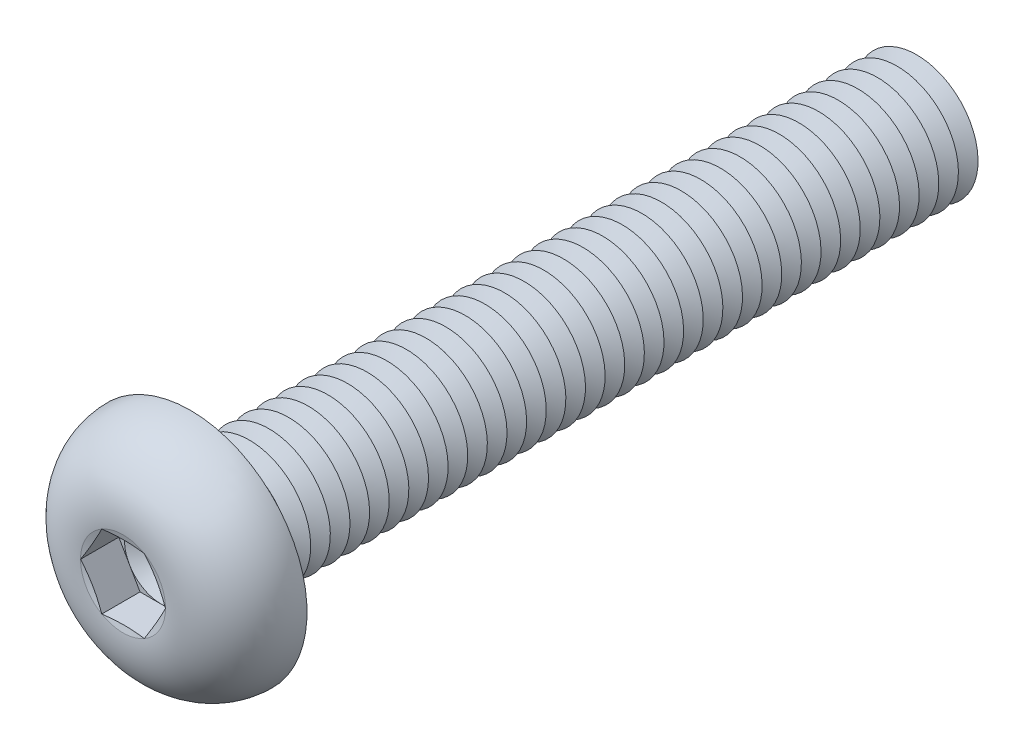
ISO-10303-21;
HEADER;
FILE_DESCRIPTION(('STEP AP214'),'2;1');
FILE_NAME('part.step','',(''),(''),'','','');
FILE_SCHEMA(('AUTOMOTIVE_DESIGN { 1 0 10303 214 1 1 1 1 }'));
ENDSEC;
DATA;
#1=APPLICATION_CONTEXT('core data for automotive mechanical design processes');
#2=APPLICATION_PROTOCOL_DEFINITION('international standard','automotive_design',2000,#1);
#3=PRODUCT_CONTEXT('',#1,'mechanical');
#4=PRODUCT('Part','Part','',(#3));
#5=PRODUCT_RELATED_PRODUCT_CATEGORY('part','',(#4));
#6=PRODUCT_DEFINITION_FORMATION('','',#4);
#7=PRODUCT_DEFINITION_CONTEXT('part definition',#1,'design');
#8=PRODUCT_DEFINITION('design','',#6,#7);
#9=PRODUCT_DEFINITION_SHAPE('','',#8);
#10=(LENGTH_UNIT() NAMED_UNIT(*) SI_UNIT(.MILLI.,.METRE.));
#11=(NAMED_UNIT(*) PLANE_ANGLE_UNIT() SI_UNIT($,.RADIAN.));
#12=(NAMED_UNIT(*) SI_UNIT($,.STERADIAN.) SOLID_ANGLE_UNIT());
#13=UNCERTAINTY_MEASURE_WITH_UNIT(LENGTH_MEASURE(1.E-05),#10,'distance_accuracy_value','');
#14=(GEOMETRIC_REPRESENTATION_CONTEXT(3) GLOBAL_UNCERTAINTY_ASSIGNED_CONTEXT((#13)) GLOBAL_UNIT_ASSIGNED_CONTEXT((#10,
#11,#12)) REPRESENTATION_CONTEXT('',''));
#15=CARTESIAN_POINT('',(0.,0.,0.));
#16=DIRECTION('',(0.,0.,1.));
#17=DIRECTION('',(1.,0.,0.));
#18=AXIS2_PLACEMENT_3D('',#15,#16,#17);
#19=CARTESIAN_POINT('',(0.,0.,1.19));
#20=DIRECTION('',(0.,0.,1.));
#21=DIRECTION('',(1.,0.,0.));
#22=AXIS2_PLACEMENT_3D('',#19,#20,#21);
#23=PLANE('',#22);
#24=CARTESIAN_POINT('',(0.,0.,1.19));
#25=DIRECTION('',(0.,0.,1.));
#26=DIRECTION('',(1.,0.,0.));
#27=AXIS2_PLACEMENT_3D('',#24,#25,#26);
#28=CIRCLE('',#27,1.49999930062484);
#29=CARTESIAN_POINT('',(1.2990375,0.749999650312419,1.19));
#30=VERTEX_POINT('',#29);
#31=CARTESIAN_POINT('',(0.,1.49999930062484,1.19));
#32=VERTEX_POINT('',#31);
#33=EDGE_CURVE('E118',#30,#32,#28,.T.);
#34=ORIENTED_EDGE('',*,*,#33,.F.);
#35=DIRECTION('',(-0.5,0.866025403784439,0.));
#36=VECTOR('',#35,1.);
#37=CARTESIAN_POINT('',(1.73205,0.,1.19));
#38=LINE('',#37,#36);
#39=CARTESIAN_POINT('',(0.866025,1.49999930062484,1.19));
#40=VERTEX_POINT('',#39);
#41=EDGE_CURVE('E125',#30,#40,#38,.T.);
#42=ORIENTED_EDGE('',*,*,#41,.T.);
#43=DIRECTION('',(-1.,0.,0.));
#44=VECTOR('',#43,1.);
#45=CARTESIAN_POINT('',(0.866025,1.49999930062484,1.19));
#46=LINE('',#45,#44);
#47=EDGE_CURVE('E136',#40,#32,#46,.T.);
#48=ORIENTED_EDGE('',*,*,#47,.T.);
#49=EDGE_LOOP('',(#34,#42,#48));
#50=FACE_BOUND('',#49,.T.);
#51=ADVANCED_FACE('F39',(#50),#23,.T.);
#52=CARTESIAN_POINT('',(0.,0.,1.19));
#53=DIRECTION('',(0.,0.,1.));
#54=DIRECTION('',(1.,0.,0.));
#55=AXIS2_PLACEMENT_3D('',#52,#53,#54);
#56=CIRCLE('',#55,1.49999930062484);
#57=CARTESIAN_POINT('',(-1.2990375,0.749999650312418,1.19));
#58=VERTEX_POINT('',#57);
#59=EDGE_CURVE('E11',#32,#58,#56,.T.);
#60=ORIENTED_EDGE('',*,*,#59,.F.);
#61=CARTESIAN_POINT('',(-0.866025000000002,1.49999930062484,1.19));
#62=VERTEX_POINT('',#61);
#63=EDGE_CURVE('E131',#32,#62,#46,.T.);
#64=ORIENTED_EDGE('',*,*,#63,.T.);
#65=DIRECTION('',(-0.5,-0.866025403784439,0.));
#66=VECTOR('',#65,1.);
#67=CARTESIAN_POINT('',(-0.866025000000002,1.49999930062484,1.19));
#68=LINE('',#67,#66);
#69=EDGE_CURVE('E134',#62,#58,#68,.T.);
#70=ORIENTED_EDGE('',*,*,#69,.T.);
#71=EDGE_LOOP('',(#60,#64,#70));
#72=FACE_BOUND('',#71,.T.);
#73=ADVANCED_FACE('F130',(#72),#23,.T.);
#74=CARTESIAN_POINT('',(-1.2990375,-0.749999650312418,1.19));
#75=VERTEX_POINT('',#74);
#76=EDGE_CURVE('E49',#58,#75,#56,.T.);
#77=ORIENTED_EDGE('',*,*,#76,.F.);
#78=CARTESIAN_POINT('',(-1.73205,0.,1.19));
#79=VERTEX_POINT('',#78);
#80=EDGE_CURVE('E143',#58,#79,#68,.T.);
#81=ORIENTED_EDGE('',*,*,#80,.T.);
#82=DIRECTION('',(0.5,-0.866025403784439,0.));
#83=VECTOR('',#82,1.);
#84=CARTESIAN_POINT('',(-1.73205,0.,1.19));
#85=LINE('',#84,#83);
#86=EDGE_CURVE('E152',#79,#75,#85,.T.);
#87=ORIENTED_EDGE('',*,*,#86,.T.);
#88=EDGE_LOOP('',(#77,#81,#87));
#89=FACE_BOUND('',#88,.T.);
#90=ADVANCED_FACE('F567',(#89),#23,.T.);
#91=CARTESIAN_POINT('',(0.,-1.49999930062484,1.19));
#92=VERTEX_POINT('',#91);
#93=EDGE_CURVE('E551',#75,#92,#56,.T.);
#94=ORIENTED_EDGE('',*,*,#93,.F.);
#95=CARTESIAN_POINT('',(-0.866025,-1.49999930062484,1.19));
#96=VERTEX_POINT('',#95);
#97=EDGE_CURVE('E151',#75,#96,#85,.T.);
#98=ORIENTED_EDGE('',*,*,#97,.T.);
#99=DIRECTION('',(1.,0.,0.));
#100=VECTOR('',#99,1.);
#101=CARTESIAN_POINT('',(-0.866025,-1.49999930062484,1.19));
#102=LINE('',#101,#100);
#103=EDGE_CURVE('E156',#96,#92,#102,.T.);
#104=ORIENTED_EDGE('',*,*,#103,.T.);
#105=EDGE_LOOP('',(#94,#98,#104));
#106=FACE_BOUND('',#105,.T.);
#107=ADVANCED_FACE('F560',(#106),#23,.T.);
#108=CARTESIAN_POINT('',(1.2990375,-0.749999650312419,1.19));
#109=VERTEX_POINT('',#108);
#110=EDGE_CURVE('E56',#92,#109,#56,.T.);
#111=ORIENTED_EDGE('',*,*,#110,.F.);
#112=CARTESIAN_POINT('',(0.866025,-1.49999930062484,1.19));
#113=VERTEX_POINT('',#112);
#114=EDGE_CURVE('E155',#92,#113,#102,.T.);
#115=ORIENTED_EDGE('',*,*,#114,.T.);
#116=DIRECTION('',(0.5,0.866025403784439,0.));
#117=VECTOR('',#116,1.);
#118=CARTESIAN_POINT('',(0.866025,-1.49999930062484,1.19));
#119=LINE('',#118,#117);
#120=EDGE_CURVE('E161',#113,#109,#119,.T.);
#121=ORIENTED_EDGE('',*,*,#120,.T.);
#122=EDGE_LOOP('',(#111,#115,#121));
#123=FACE_BOUND('',#122,.T.);
#124=ADVANCED_FACE('F637',(#123),#23,.T.);
#125=CARTESIAN_POINT('',(0.,0.,2.75));
#126=DIRECTION('',(0.,0.,1.));
#127=DIRECTION('',(0.,-1.,0.));
#128=AXIS2_PLACEMENT_3D('',#125,#126,#127);
#129=CONICAL_SURFACE('',#128,1.73205,1.30899693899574);
#130=CARTESIAN_POINT('',(1.73216547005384,-0.00020000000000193,2.75003094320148));
#131=CARTESIAN_POINT('',(1.69619207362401,0.0621077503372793,2.74038633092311));
#132=CARTESIAN_POINT('',(1.66015343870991,0.124528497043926,2.73163050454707));
#133=CARTESIAN_POINT('',(1.58794885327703,0.249590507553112,2.71624720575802));
#134=CARTESIAN_POINT('',(1.5517828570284,0.312231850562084,2.70962059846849));
#135=CARTESIAN_POINT('',(1.47954289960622,0.437355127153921,2.69888271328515));
#136=CARTESIAN_POINT('',(1.4434694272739,0.499836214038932,2.69475862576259));
#137=CARTESIAN_POINT('',(1.37127646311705,0.624878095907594,2.68922863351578));
#138=CARTESIAN_POINT('',(1.33515698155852,0.687438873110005,2.68782220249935));
#139=CARTESIAN_POINT('',(1.26291801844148,0.812560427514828,2.68782220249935));
#140=CARTESIAN_POINT('',(1.22679853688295,0.875121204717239,2.68922863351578));
#141=CARTESIAN_POINT('',(1.1546055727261,1.0001630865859,2.69475862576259));
#142=CARTESIAN_POINT('',(1.11853210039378,1.06264417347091,2.69888271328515));
#143=CARTESIAN_POINT('',(1.0462921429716,1.18776745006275,2.70962059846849));
#144=CARTESIAN_POINT('',(1.01012614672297,1.25040879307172,2.71624720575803));
#145=CARTESIAN_POINT('',(0.937921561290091,1.37547080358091,2.73163050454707));
#146=CARTESIAN_POINT('',(0.901882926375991,1.43789155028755,2.74038633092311));
#147=CARTESIAN_POINT('',(0.865909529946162,1.50019930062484,2.75003094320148));
#148=B_SPLINE_CURVE_WITH_KNOTS('',3,(#130,#131,#132,#133,#134,#135,#136,#137,#138,#139,#140,
#141,#142,#143,#144,#145,#146,#147),.UNSPECIFIED.,.F.,.F.,(4,2,2,2,2,2,2,2,4),(0.,
0.217782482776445,0.435653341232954,0.652399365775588,0.869103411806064,1.08580745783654,
1.30255348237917,1.52042434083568,1.73820682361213),.UNSPECIFIED.);
#149=CARTESIAN_POINT('',(1.73205,0.,2.75));
#150=VERTEX_POINT('',#149);
#151=CARTESIAN_POINT('',(0.866025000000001,1.49999930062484,2.75));
#152=VERTEX_POINT('',#151);
#153=EDGE_CURVE('E220',#150,#152,#148,.T.);
#154=ORIENTED_EDGE('',*,*,#153,.F.);
#155=CARTESIAN_POINT('',(0.,0.,2.75));
#156=DIRECTION('',(0.,0.,-1.));
#157=DIRECTION('',(0.,1.,0.));
#158=AXIS2_PLACEMENT_3D('',#155,#156,#157);
#159=CIRCLE('',#158,1.73205);
#160=EDGE_CURVE('E532',#152,#150,#159,.T.);
#161=ORIENTED_EDGE('',*,*,#160,.F.);
#162=EDGE_LOOP('',(#154,#161));
#163=FACE_BOUND('',#162,.T.);
#164=ADVANCED_FACE('F641',(#163),#129,.F.);
#165=CARTESIAN_POINT('',(0.865909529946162,-1.50019930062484,2.75003094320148));
#166=CARTESIAN_POINT('',(0.901882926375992,-1.43789155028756,2.74038633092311));
#167=CARTESIAN_POINT('',(0.937921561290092,-1.37547080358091,2.73163050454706));
#168=CARTESIAN_POINT('',(1.01012614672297,-1.25040879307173,2.71624720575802));
#169=CARTESIAN_POINT('',(1.0462921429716,-1.18776745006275,2.70962059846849));
#170=CARTESIAN_POINT('',(1.11853210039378,-1.06264417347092,2.69888271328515));
#171=CARTESIAN_POINT('',(1.1546055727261,-1.00016308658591,2.69475862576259));
#172=CARTESIAN_POINT('',(1.22679853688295,-0.875121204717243,2.68922863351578));
#173=CARTESIAN_POINT('',(1.26291801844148,-0.812560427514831,2.68782220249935));
#174=CARTESIAN_POINT('',(1.33515698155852,-0.687438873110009,2.68782220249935));
#175=CARTESIAN_POINT('',(1.37127646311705,-0.624878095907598,2.68922863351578));
#176=CARTESIAN_POINT('',(1.4434694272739,-0.499836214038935,2.69475862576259));
#177=CARTESIAN_POINT('',(1.47954289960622,-0.437355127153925,2.69888271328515));
#178=CARTESIAN_POINT('',(1.5517828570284,-0.312231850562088,2.70962059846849));
#179=CARTESIAN_POINT('',(1.58794885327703,-0.249590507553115,2.71624720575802));
#180=CARTESIAN_POINT('',(1.66015343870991,-0.12452849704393,2.73163050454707));
#181=CARTESIAN_POINT('',(1.69619207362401,-0.0621077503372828,2.74038633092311));
#182=CARTESIAN_POINT('',(1.73216547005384,0.000199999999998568,2.75003094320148));
#183=B_SPLINE_CURVE_WITH_KNOTS('',3,(#165,#166,#167,#168,#169,#170,#171,#172,#173,#174,#175,
#176,#177,#178,#179,#180,#181,#182),.UNSPECIFIED.,.F.,.F.,(4,2,2,2,2,2,2,2,4),(0.,
0.217782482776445,0.435653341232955,0.652399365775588,0.869103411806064,1.08580745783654,
1.30255348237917,1.52042434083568,1.73820682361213),.UNSPECIFIED.);
#184=CARTESIAN_POINT('',(0.866025,-1.49999930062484,2.75));
#185=VERTEX_POINT('',#184);
#186=EDGE_CURVE('E229',#185,#150,#183,.T.);
#187=ORIENTED_EDGE('',*,*,#186,.F.);
#188=EDGE_CURVE('E537',#150,#185,#159,.T.);
#189=ORIENTED_EDGE('',*,*,#188,.F.);
#190=EDGE_LOOP('',(#187,#189));
#191=FACE_BOUND('',#190,.T.);
#192=ADVANCED_FACE('F603',(#191),#129,.F.);
#193=CARTESIAN_POINT('',(-2.61375031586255,-1.49999930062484,3.09338600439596));
#194=CARTESIAN_POINT('',(-2.48719895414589,-1.49999930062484,3.06401688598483));
#195=CARTESIAN_POINT('',(-2.36054180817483,-1.49999930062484,3.03507426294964));
#196=CARTESIAN_POINT('',(-2.10688190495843,-1.49999930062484,2.97862489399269));
#197=CARTESIAN_POINT('',(-1.97987908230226,-1.49999930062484,2.95111844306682));
#198=CARTESIAN_POINT('',(-1.72425281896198,-1.49999930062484,2.89788845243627));
#199=CARTESIAN_POINT('',(-1.59562534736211,-1.49999930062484,2.87218404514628));
#200=CARTESIAN_POINT('',(-1.33776732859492,-1.49999930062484,2.82387586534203));
#201=CARTESIAN_POINT('',(-1.20853672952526,-1.49999930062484,2.80127236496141));
#202=CARTESIAN_POINT('',(-0.952831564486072,-1.49999930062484,2.76126658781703));
#203=CARTESIAN_POINT('',(-0.826376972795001,-1.49999930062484,2.74374018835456));
#204=CARTESIAN_POINT('',(-0.572755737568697,-1.49999930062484,2.71502809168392));
#205=CARTESIAN_POINT('',(-0.445589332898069,-1.49999930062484,2.70384038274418));
#206=CARTESIAN_POINT('',(-0.191333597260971,-1.49999930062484,2.68972083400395));
#207=CARTESIAN_POINT('',(-0.0642464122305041,-1.49999930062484,2.68675270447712));
#208=CARTESIAN_POINT('',(0.189835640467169,-1.49999930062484,2.68959577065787));
#209=CARTESIAN_POINT('',(0.316830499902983,-1.49999930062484,2.69540767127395));
#210=CARTESIAN_POINT('',(0.534182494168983,-1.49999930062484,2.71190493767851));
#211=CARTESIAN_POINT('',(0.624691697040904,-1.49999930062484,2.72073513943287));
#212=CARTESIAN_POINT('',(0.805336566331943,-1.49999930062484,2.74156379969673));
#213=CARTESIAN_POINT('',(0.895472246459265,-1.49999930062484,2.75356214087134));
#214=CARTESIAN_POINT('',(1.0756572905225,-1.49999930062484,2.78006977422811));
#215=CARTESIAN_POINT('',(1.16570548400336,-1.49999930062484,2.7945868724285));
#216=CARTESIAN_POINT('',(1.3454787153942,-1.49999930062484,2.82550612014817));
#217=CARTESIAN_POINT('',(1.43520373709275,-1.49999930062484,2.8419083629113));
#218=CARTESIAN_POINT('',(1.61622412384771,-1.49999930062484,2.87648604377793));
#219=CARTESIAN_POINT('',(1.70751379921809,-1.49999930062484,2.89469103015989));
#220=CARTESIAN_POINT('',(1.88986344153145,-1.49999930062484,2.93221618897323));
#221=CARTESIAN_POINT('',(1.98092340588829,-1.49999930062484,2.95153637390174));
#222=CARTESIAN_POINT('',(2.16236354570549,-1.49999930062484,2.99091506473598));
#223=CARTESIAN_POINT('',(2.25274472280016,-1.49999930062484,3.01096897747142));
#224=CARTESIAN_POINT('',(2.43335289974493,-1.49999930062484,3.05173139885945));
#225=CARTESIAN_POINT('',(2.52357990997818,-1.49999930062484,3.07243986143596));
#226=CARTESIAN_POINT('',(2.61375031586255,-1.49999930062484,3.09338600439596));
#227=B_SPLINE_CURVE_WITH_KNOTS('',3,(#193,#194,#195,#196,#197,#198,#199,#200,#201,#202,#203,
#204,#205,#206,#207,#208,#209,#210,#211,#212,#213,#214,#215,#216,#217,#218,#219,#220,#221,#222,
#223,#224,#225,#226),.UNSPECIFIED.,.F.,.F.,(4,2,2,2,2,2,2,2,2,2,2,2,2,2,2,2,4),(0.,
0.389753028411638,0.779585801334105,1.17307326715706,1.56659524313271,1.94947555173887,
2.33223427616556,2.71330039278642,3.09439710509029,3.36715350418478,3.63989980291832,
3.91350699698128,4.18712773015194,4.46638029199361,4.74563598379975,5.02337106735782,
5.3010866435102),.UNSPECIFIED.);
#228=CARTESIAN_POINT('',(-0.866025,-1.49999930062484,2.75));
#229=VERTEX_POINT('',#228);
#230=EDGE_CURVE('E581',#229,#185,#227,.T.);
#231=ORIENTED_EDGE('',*,*,#230,.F.);
#232=EDGE_CURVE('E594',#185,#229,#159,.T.);
#233=ORIENTED_EDGE('',*,*,#232,.F.);
#234=EDGE_LOOP('',(#231,#233));
#235=FACE_BOUND('',#234,.T.);
#236=ADVANCED_FACE('F609',(#235),#129,.F.);
#237=CARTESIAN_POINT('',(-1.73216547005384,0.000199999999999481,2.75003094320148));
#238=CARTESIAN_POINT('',(-1.69619207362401,-0.0621077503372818,2.74038633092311));
#239=CARTESIAN_POINT('',(-1.66015343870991,-0.124528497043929,2.73163050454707));
#240=CARTESIAN_POINT('',(-1.58794885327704,-0.249590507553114,2.71624720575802));
#241=CARTESIAN_POINT('',(-1.55178285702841,-0.312231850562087,2.70962059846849));
#242=CARTESIAN_POINT('',(-1.47954289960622,-0.437355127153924,2.69888271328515));
#243=CARTESIAN_POINT('',(-1.4434694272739,-0.499836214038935,2.69475862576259));
#244=CARTESIAN_POINT('',(-1.37127646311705,-0.624878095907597,2.68922863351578));
#245=CARTESIAN_POINT('',(-1.33515698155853,-0.687438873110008,2.68782220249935));
#246=CARTESIAN_POINT('',(-1.26291801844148,-0.812560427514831,2.68782220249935));
#247=CARTESIAN_POINT('',(-1.22679853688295,-0.875121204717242,2.68922863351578));
#248=CARTESIAN_POINT('',(-1.1546055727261,-1.0001630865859,2.69475862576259));
#249=CARTESIAN_POINT('',(-1.11853210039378,-1.06264417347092,2.69888271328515));
#250=CARTESIAN_POINT('',(-1.0462921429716,-1.18776745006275,2.70962059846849));
#251=CARTESIAN_POINT('',(-1.01012614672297,-1.25040879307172,2.71624720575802));
#252=CARTESIAN_POINT('',(-0.937921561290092,-1.37547080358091,2.73163050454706));
#253=CARTESIAN_POINT('',(-0.901882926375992,-1.43789155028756,2.74038633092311));
#254=CARTESIAN_POINT('',(-0.865909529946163,-1.50019930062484,2.75003094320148));
#255=B_SPLINE_CURVE_WITH_KNOTS('',3,(#237,#238,#239,#240,#241,#242,#243,#244,#245,#246,#247,
#248,#249,#250,#251,#252,#253,#254),.UNSPECIFIED.,.F.,.F.,(4,2,2,2,2,2,2,2,4),(0.,
0.217782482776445,0.435653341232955,0.652399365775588,0.869103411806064,1.08580745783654,
1.30255348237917,1.52042434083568,1.73820682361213),.UNSPECIFIED.);
#256=CARTESIAN_POINT('',(-1.73205,0.,2.75));
#257=VERTEX_POINT('',#256);
#258=EDGE_CURVE('E572',#257,#229,#255,.T.);
#259=ORIENTED_EDGE('',*,*,#258,.F.);
#260=EDGE_CURVE('E578',#229,#257,#159,.T.);
#261=ORIENTED_EDGE('',*,*,#260,.F.);
#262=EDGE_LOOP('',(#259,#261));
#263=FACE_BOUND('',#262,.T.);
#264=ADVANCED_FACE('F576',(#263),#129,.F.);
#265=CARTESIAN_POINT('',(-0.865909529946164,1.50019930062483,2.75003094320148));
#266=CARTESIAN_POINT('',(-0.901882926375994,1.43789155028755,2.74038633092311));
#267=CARTESIAN_POINT('',(-0.937921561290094,1.37547080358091,2.73163050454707));
#268=CARTESIAN_POINT('',(-1.01012614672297,1.25040879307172,2.71624720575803));
#269=CARTESIAN_POINT('',(-1.0462921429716,1.18776745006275,2.70962059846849));
#270=CARTESIAN_POINT('',(-1.11853210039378,1.06264417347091,2.69888271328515));
#271=CARTESIAN_POINT('',(-1.1546055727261,1.0001630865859,2.69475862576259));
#272=CARTESIAN_POINT('',(-1.22679853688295,0.87512120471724,2.68922863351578));
#273=CARTESIAN_POINT('',(-1.26291801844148,0.812560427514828,2.68782220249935));
#274=CARTESIAN_POINT('',(-1.33515698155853,0.687438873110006,2.68782220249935));
#275=CARTESIAN_POINT('',(-1.37127646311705,0.624878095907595,2.68922863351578));
#276=CARTESIAN_POINT('',(-1.4434694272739,0.499836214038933,2.69475862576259));
#277=CARTESIAN_POINT('',(-1.47954289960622,0.437355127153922,2.69888271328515));
#278=CARTESIAN_POINT('',(-1.55178285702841,0.312231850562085,2.70962059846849));
#279=CARTESIAN_POINT('',(-1.58794885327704,0.249590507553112,2.71624720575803));
#280=CARTESIAN_POINT('',(-1.66015343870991,0.124528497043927,2.73163050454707));
#281=CARTESIAN_POINT('',(-1.69619207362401,0.0621077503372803,2.74038633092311));
#282=CARTESIAN_POINT('',(-1.73216547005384,-0.000200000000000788,2.75003094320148));
#283=B_SPLINE_CURVE_WITH_KNOTS('',3,(#265,#266,#267,#268,#269,#270,#271,#272,#273,#274,#275,
#276,#277,#278,#279,#280,#281,#282),.UNSPECIFIED.,.F.,.F.,(4,2,2,2,2,2,2,2,4),(0.,
0.217782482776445,0.435653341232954,0.652399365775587,0.869103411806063,1.08580745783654,
1.30255348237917,1.52042434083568,1.73820682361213),.UNSPECIFIED.);
#284=CARTESIAN_POINT('',(-0.866025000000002,1.49999930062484,2.75));
#285=VERTEX_POINT('',#284);
#286=EDGE_CURVE('E193',#285,#257,#283,.T.);
#287=ORIENTED_EDGE('',*,*,#286,.F.);
#288=EDGE_CURVE('E584',#257,#285,#159,.T.);
#289=ORIENTED_EDGE('',*,*,#288,.F.);
#290=EDGE_LOOP('',(#287,#289));
#291=FACE_BOUND('',#290,.T.);
#292=ADVANCED_FACE('F585',(#291),#129,.F.);
#293=CARTESIAN_POINT('',(0.,0.,-27.2));
#294=DIRECTION('',(0.,0.,1.));
#295=DIRECTION('',(0.,-1.,0.));
#296=AXIS2_PLACEMENT_3D('',#293,#294,#295);
#297=CONICAL_SURFACE('',#296,2.49999999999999,1.0471975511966);
#298=CARTESIAN_POINT('',(0.,0.,-27.6));
#299=DIRECTION('',(0.,0.,1.));
#300=DIRECTION('',(0.,-1.,0.));
#301=AXIS2_PLACEMENT_3D('',#298,#299,#300);
#302=CIRCLE('',#301,1.80717967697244);
#303=CARTESIAN_POINT('',(0.,-1.80717967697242,-27.6));
#304=VERTEX_POINT('',#303);
#305=EDGE_CURVE('E503',#304,#304,#302,.T.);
#306=ORIENTED_EDGE('',*,*,#305,.T.);
#307=EDGE_LOOP('',(#306));
#308=FACE_BOUND('',#307,.T.);
#309=CARTESIAN_POINT('',(0.,0.,-27.2));
#310=DIRECTION('',(0.,0.,1.));
#311=DIRECTION('',(0.,-1.,0.));
#312=AXIS2_PLACEMENT_3D('',#309,#310,#311);
#313=CIRCLE('',#312,2.49999999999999);
#314=CARTESIAN_POINT('',(0.,-2.49999999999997,-27.2));
#315=VERTEX_POINT('',#314);
#316=EDGE_CURVE('E499',#315,#315,#313,.T.);
#317=ORIENTED_EDGE('',*,*,#316,.F.);
#318=EDGE_LOOP('',(#317));
#319=FACE_BOUND('',#318,.T.);
#320=ADVANCED_FACE('F670',(#308,#319),#297,.T.);
#321=CARTESIAN_POINT('',(0.,0.,-27.6));
#322=DIRECTION('',(0.,0.,-1.));
#323=DIRECTION('',(0.,1.,0.));
#324=AXIS2_PLACEMENT_3D('',#321,#322,#323);
#325=CONICAL_SURFACE('',#324,1.80717967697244,1.0471975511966);
#326=CARTESIAN_POINT('',(0.,0.,-28.));
#327=DIRECTION('',(0.,0.,1.));
#328=DIRECTION('',(0.,-1.,0.));
#329=AXIS2_PLACEMENT_3D('',#326,#327,#328);
#330=CIRCLE('',#329,2.49999999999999);
#331=CARTESIAN_POINT('',(0.,-2.49999999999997,-28.));
#332=VERTEX_POINT('',#331);
#333=EDGE_CURVE('E507',#332,#332,#330,.T.);
#334=ORIENTED_EDGE('',*,*,#333,.T.);
#335=EDGE_LOOP('',(#334));
#336=FACE_BOUND('',#335,.T.);
#337=ORIENTED_EDGE('',*,*,#305,.F.);
#338=EDGE_LOOP('',(#337));
#339=FACE_BOUND('',#338,.T.);
#340=ADVANCED_FACE('F675',(#336,#339),#325,.T.);
#341=CARTESIAN_POINT('',(0.,2.5,-30.));
#342=DIRECTION('',(0.,0.,-1.));
#343=DIRECTION('',(0.,1.,0.));
#344=AXIS2_PLACEMENT_3D('',#341,#342,#343);
#345=PLANE('',#344);
#346=CARTESIAN_POINT('',(0.,0.,-30.));
#347=DIRECTION('',(0.,0.,1.));
#348=DIRECTION('',(0.,-1.,0.));
#349=AXIS2_PLACEMENT_3D('',#346,#347,#348);
#350=CIRCLE('',#349,1.80717967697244);
#351=CARTESIAN_POINT('',(0.,-1.80717967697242,-30.));
#352=VERTEX_POINT('',#351);
#353=EDGE_CURVE('E527',#352,#352,#350,.T.);
#354=ORIENTED_EDGE('',*,*,#353,.F.);
#355=EDGE_LOOP('',(#354));
#356=FACE_BOUND('',#355,.T.);
#357=ADVANCED_FACE('F850',(#356),#345,.T.);
#358=CARTESIAN_POINT('',(0.,0.,-29.6));
#359=DIRECTION('',(0.,0.,1.));
#360=DIRECTION('',(0.,-1.,0.));
#361=AXIS2_PLACEMENT_3D('',#358,#359,#360);
#362=CONICAL_SURFACE('',#361,2.49999999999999,1.0471975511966);
#363=ORIENTED_EDGE('',*,*,#353,.T.);
#364=EDGE_LOOP('',(#363));
#365=FACE_BOUND('',#364,.T.);
#366=CARTESIAN_POINT('',(0.,0.,-29.6));
#367=DIRECTION('',(0.,0.,1.));
#368=DIRECTION('',(0.,-1.,0.));
#369=AXIS2_PLACEMENT_3D('',#366,#367,#368);
#370=CIRCLE('',#369,2.49999999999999);
#371=CARTESIAN_POINT('',(0.,-2.49999999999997,-29.6));
#372=VERTEX_POINT('',#371);
#373=EDGE_CURVE('E523',#372,#372,#370,.T.);
#374=ORIENTED_EDGE('',*,*,#373,.F.);
#375=EDGE_LOOP('',(#374));
#376=FACE_BOUND('',#375,.T.);
#377=ADVANCED_FACE('F843',(#365,#376),#362,.T.);
#378=CARTESIAN_POINT('',(0.,0.,-29.2));
#379=DIRECTION('',(0.,0.,-1.));
#380=DIRECTION('',(0.,1.,0.));
#381=AXIS2_PLACEMENT_3D('',#378,#379,#380);
#382=CONICAL_SURFACE('',#381,1.80717967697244,1.0471975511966);
#383=ORIENTED_EDGE('',*,*,#373,.T.);
#384=EDGE_LOOP('',(#383));
#385=FACE_BOUND('',#384,.T.);
#386=CARTESIAN_POINT('',(0.,0.,-29.2));
#387=DIRECTION('',(0.,0.,1.));
#388=DIRECTION('',(0.,-1.,0.));
#389=AXIS2_PLACEMENT_3D('',#386,#387,#388);
#390=CIRCLE('',#389,1.80717967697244);
#391=CARTESIAN_POINT('',(0.,-1.80717967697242,-29.2));
#392=VERTEX_POINT('',#391);
#393=EDGE_CURVE('E519',#392,#392,#390,.T.);
#394=ORIENTED_EDGE('',*,*,#393,.F.);
#395=EDGE_LOOP('',(#394));
#396=FACE_BOUND('',#395,.T.);
#397=ADVANCED_FACE('F849',(#385,#396),#382,.T.);
#398=CARTESIAN_POINT('',(0.,0.,-28.8));
#399=DIRECTION('',(0.,0.,1.));
#400=DIRECTION('',(0.,-1.,0.));
#401=AXIS2_PLACEMENT_3D('',#398,#399,#400);
#402=CONICAL_SURFACE('',#401,2.49999999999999,1.0471975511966);
#403=ORIENTED_EDGE('',*,*,#393,.T.);
#404=EDGE_LOOP('',(#403));
#405=FACE_BOUND('',#404,.T.);
#406=CARTESIAN_POINT('',(0.,0.,-28.8));
#407=DIRECTION('',(0.,0.,1.));
#408=DIRECTION('',(0.,-1.,0.));
#409=AXIS2_PLACEMENT_3D('',#406,#407,#408);
#410=CIRCLE('',#409,2.49999999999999);
#411=CARTESIAN_POINT('',(0.,-2.49999999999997,-28.8));
#412=VERTEX_POINT('',#411);
#413=EDGE_CURVE('E515',#412,#412,#410,.T.);
#414=ORIENTED_EDGE('',*,*,#413,.F.);
#415=EDGE_LOOP('',(#414));
#416=FACE_BOUND('',#415,.T.);
#417=ADVANCED_FACE('F881',(#405,#416),#402,.T.);
#418=CARTESIAN_POINT('',(0.,0.,-28.4));
#419=DIRECTION('',(0.,0.,-1.));
#420=DIRECTION('',(0.,1.,0.));
#421=AXIS2_PLACEMENT_3D('',#418,#419,#420);
#422=CONICAL_SURFACE('',#421,1.80717967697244,1.0471975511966);
#423=ORIENTED_EDGE('',*,*,#413,.T.);
#424=EDGE_LOOP('',(#423));
#425=FACE_BOUND('',#424,.T.);
#426=CARTESIAN_POINT('',(0.,0.,-28.4));
#427=DIRECTION('',(0.,0.,1.));
#428=DIRECTION('',(0.,-1.,0.));
#429=AXIS2_PLACEMENT_3D('',#426,#427,#428);
#430=CIRCLE('',#429,1.80717967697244);
#431=CARTESIAN_POINT('',(0.,-1.80717967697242,-28.4));
#432=VERTEX_POINT('',#431);
#433=EDGE_CURVE('E511',#432,#432,#430,.T.);
#434=ORIENTED_EDGE('',*,*,#433,.F.);
#435=EDGE_LOOP('',(#434));
#436=FACE_BOUND('',#435,.T.);
#437=ADVANCED_FACE('F891',(#425,#436),#422,.T.);
#438=CARTESIAN_POINT('',(0.,0.,-28.));
#439=DIRECTION('',(0.,0.,1.));
#440=DIRECTION('',(0.,-1.,0.));
#441=AXIS2_PLACEMENT_3D('',#438,#439,#440);
#442=CONICAL_SURFACE('',#441,2.49999999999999,1.0471975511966);
#443=ORIENTED_EDGE('',*,*,#433,.T.);
#444=EDGE_LOOP('',(#443));
#445=FACE_BOUND('',#444,.T.);
#446=ORIENTED_EDGE('',*,*,#333,.F.);
#447=EDGE_LOOP('',(#446));
#448=FACE_BOUND('',#447,.T.);
#449=ADVANCED_FACE('F901',(#445,#448),#442,.T.);
#450=CARTESIAN_POINT('',(0.,0.,-26.4));
#451=DIRECTION('',(0.,0.,1.));
#452=DIRECTION('',(0.,-1.,0.));
#453=AXIS2_PLACEMENT_3D('',#450,#451,#452);
#454=CONICAL_SURFACE('',#453,2.49999999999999,1.0471975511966);
#455=CARTESIAN_POINT('',(0.,0.,-26.8));
#456=DIRECTION('',(0.,0.,1.));
#457=DIRECTION('',(0.,-1.,0.));
#458=AXIS2_PLACEMENT_3D('',#455,#456,#457);
#459=CIRCLE('',#458,1.80717967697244);
#460=CARTESIAN_POINT('',(0.,-1.80717967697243,-26.8));
#461=VERTEX_POINT('',#460);
#462=EDGE_CURVE('E495',#461,#461,#459,.T.);
#463=ORIENTED_EDGE('',*,*,#462,.T.);
#464=EDGE_LOOP('',(#463));
#465=FACE_BOUND('',#464,.T.);
#466=CARTESIAN_POINT('',(0.,0.,-26.4));
#467=DIRECTION('',(0.,0.,1.));
#468=DIRECTION('',(0.,-1.,0.));
#469=AXIS2_PLACEMENT_3D('',#466,#467,#468);
#470=CIRCLE('',#469,2.49999999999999);
#471=CARTESIAN_POINT('',(0.,-2.49999999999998,-26.4));
#472=VERTEX_POINT('',#471);
#473=EDGE_CURVE('E491',#472,#472,#470,.T.);
#474=ORIENTED_EDGE('',*,*,#473,.F.);
#475=EDGE_LOOP('',(#474));
#476=FACE_BOUND('',#475,.T.);
#477=ADVANCED_FACE('F911',(#465,#476),#454,.T.);
#478=CARTESIAN_POINT('',(0.,0.,-26.8));
#479=DIRECTION('',(0.,0.,-1.));
#480=DIRECTION('',(0.,1.,0.));
#481=AXIS2_PLACEMENT_3D('',#478,#479,#480);
#482=CONICAL_SURFACE('',#481,1.80717967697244,1.0471975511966);
#483=ORIENTED_EDGE('',*,*,#316,.T.);
#484=EDGE_LOOP('',(#483));
#485=FACE_BOUND('',#484,.T.);
#486=ORIENTED_EDGE('',*,*,#462,.F.);
#487=EDGE_LOOP('',(#486));
#488=FACE_BOUND('',#487,.T.);
#489=ADVANCED_FACE('F921',(#485,#488),#482,.T.);
#490=CARTESIAN_POINT('',(0.,0.,-25.6));
#491=DIRECTION('',(0.,0.,1.));
#492=DIRECTION('',(0.,-1.,0.));
#493=AXIS2_PLACEMENT_3D('',#490,#491,#492);
#494=CONICAL_SURFACE('',#493,2.49999999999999,1.0471975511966);
#495=CARTESIAN_POINT('',(0.,0.,-26.));
#496=DIRECTION('',(0.,0.,1.));
#497=DIRECTION('',(0.,-1.,0.));
#498=AXIS2_PLACEMENT_3D('',#495,#496,#497);
#499=CIRCLE('',#498,1.80717967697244);
#500=CARTESIAN_POINT('',(0.,-1.80717967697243,-26.));
#501=VERTEX_POINT('',#500);
#502=EDGE_CURVE('E487',#501,#501,#499,.T.);
#503=ORIENTED_EDGE('',*,*,#502,.T.);
#504=EDGE_LOOP('',(#503));
#505=FACE_BOUND('',#504,.T.);
#506=CARTESIAN_POINT('',(0.,0.,-25.6));
#507=DIRECTION('',(0.,0.,1.));
#508=DIRECTION('',(0.,-1.,0.));
#509=AXIS2_PLACEMENT_3D('',#506,#507,#508);
#510=CIRCLE('',#509,2.49999999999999);
#511=CARTESIAN_POINT('',(0.,-2.49999999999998,-25.6));
#512=VERTEX_POINT('',#511);
#513=EDGE_CURVE('E483',#512,#512,#510,.T.);
#514=ORIENTED_EDGE('',*,*,#513,.F.);
#515=EDGE_LOOP('',(#514));
#516=FACE_BOUND('',#515,.T.);
#517=ADVANCED_FACE('F931',(#505,#516),#494,.T.);
#518=CARTESIAN_POINT('',(0.,0.,-26.));
#519=DIRECTION('',(0.,0.,-1.));
#520=DIRECTION('',(0.,1.,0.));
#521=AXIS2_PLACEMENT_3D('',#518,#519,#520);
#522=CONICAL_SURFACE('',#521,1.80717967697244,1.0471975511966);
#523=ORIENTED_EDGE('',*,*,#473,.T.);
#524=EDGE_LOOP('',(#523));
#525=FACE_BOUND('',#524,.T.);
#526=ORIENTED_EDGE('',*,*,#502,.F.);
#527=EDGE_LOOP('',(#526));
#528=FACE_BOUND('',#527,.T.);
#529=ADVANCED_FACE('F941',(#525,#528),#522,.T.);
#530=CARTESIAN_POINT('',(0.,0.,-24.8));
#531=DIRECTION('',(0.,0.,1.));
#532=DIRECTION('',(0.,-1.,0.));
#533=AXIS2_PLACEMENT_3D('',#530,#531,#532);
#534=CONICAL_SURFACE('',#533,2.49999999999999,1.0471975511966);
#535=CARTESIAN_POINT('',(0.,0.,-25.2));
#536=DIRECTION('',(0.,0.,1.));
#537=DIRECTION('',(0.,-1.,0.));
#538=AXIS2_PLACEMENT_3D('',#535,#536,#537);
#539=CIRCLE('',#538,1.80717967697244);
#540=CARTESIAN_POINT('',(0.,-1.80717967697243,-25.2));
#541=VERTEX_POINT('',#540);
#542=EDGE_CURVE('E479',#541,#541,#539,.T.);
#543=ORIENTED_EDGE('',*,*,#542,.T.);
#544=EDGE_LOOP('',(#543));
#545=FACE_BOUND('',#544,.T.);
#546=CARTESIAN_POINT('',(0.,0.,-24.8));
#547=DIRECTION('',(0.,0.,1.));
#548=DIRECTION('',(0.,-1.,0.));
#549=AXIS2_PLACEMENT_3D('',#546,#547,#548);
#550=CIRCLE('',#549,2.49999999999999);
#551=CARTESIAN_POINT('',(0.,-2.49999999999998,-24.8));
#552=VERTEX_POINT('',#551);
#553=EDGE_CURVE('E475',#552,#552,#550,.T.);
#554=ORIENTED_EDGE('',*,*,#553,.F.);
#555=EDGE_LOOP('',(#554));
#556=FACE_BOUND('',#555,.T.);
#557=ADVANCED_FACE('F951',(#545,#556),#534,.T.);
#558=CARTESIAN_POINT('',(0.,0.,-25.2));
#559=DIRECTION('',(0.,0.,-1.));
#560=DIRECTION('',(0.,1.,0.));
#561=AXIS2_PLACEMENT_3D('',#558,#559,#560);
#562=CONICAL_SURFACE('',#561,1.80717967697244,1.0471975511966);
#563=ORIENTED_EDGE('',*,*,#513,.T.);
#564=EDGE_LOOP('',(#563));
#565=FACE_BOUND('',#564,.T.);
#566=ORIENTED_EDGE('',*,*,#542,.F.);
#567=EDGE_LOOP('',(#566));
#568=FACE_BOUND('',#567,.T.);
#569=ADVANCED_FACE('F961',(#565,#568),#562,.T.);
#570=CARTESIAN_POINT('',(0.,0.,-24.));
#571=DIRECTION('',(0.,0.,1.));
#572=DIRECTION('',(0.,-1.,0.));
#573=AXIS2_PLACEMENT_3D('',#570,#571,#572);
#574=CONICAL_SURFACE('',#573,2.49999999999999,1.0471975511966);
#575=CARTESIAN_POINT('',(0.,0.,-24.4));
#576=DIRECTION('',(0.,0.,1.));
#577=DIRECTION('',(0.,-1.,0.));
#578=AXIS2_PLACEMENT_3D('',#575,#576,#577);
#579=CIRCLE('',#578,1.80717967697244);
#580=CARTESIAN_POINT('',(0.,-1.80717967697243,-24.4));
#581=VERTEX_POINT('',#580);
#582=EDGE_CURVE('E471',#581,#581,#579,.T.);
#583=ORIENTED_EDGE('',*,*,#582,.T.);
#584=EDGE_LOOP('',(#583));
#585=FACE_BOUND('',#584,.T.);
#586=CARTESIAN_POINT('',(0.,0.,-24.));
#587=DIRECTION('',(0.,0.,1.));
#588=DIRECTION('',(0.,-1.,0.));
#589=AXIS2_PLACEMENT_3D('',#586,#587,#588);
#590=CIRCLE('',#589,2.49999999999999);
#591=CARTESIAN_POINT('',(0.,-2.49999999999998,-24.));
#592=VERTEX_POINT('',#591);
#593=EDGE_CURVE('E467',#592,#592,#590,.T.);
#594=ORIENTED_EDGE('',*,*,#593,.F.);
#595=EDGE_LOOP('',(#594));
#596=FACE_BOUND('',#595,.T.);
#597=ADVANCED_FACE('F971',(#585,#596),#574,.T.);
#598=CARTESIAN_POINT('',(0.,0.,-24.4));
#599=DIRECTION('',(0.,0.,-1.));
#600=DIRECTION('',(0.,1.,0.));
#601=AXIS2_PLACEMENT_3D('',#598,#599,#600);
#602=CONICAL_SURFACE('',#601,1.80717967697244,1.0471975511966);
#603=ORIENTED_EDGE('',*,*,#553,.T.);
#604=EDGE_LOOP('',(#603));
#605=FACE_BOUND('',#604,.T.);
#606=ORIENTED_EDGE('',*,*,#582,.F.);
#607=EDGE_LOOP('',(#606));
#608=FACE_BOUND('',#607,.T.);
#609=ADVANCED_FACE('F981',(#605,#608),#602,.T.);
#610=CARTESIAN_POINT('',(0.,0.,-23.2));
#611=DIRECTION('',(0.,0.,1.));
#612=DIRECTION('',(0.,-1.,0.));
#613=AXIS2_PLACEMENT_3D('',#610,#611,#612);
#614=CONICAL_SURFACE('',#613,2.49999999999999,1.0471975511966);
#615=CARTESIAN_POINT('',(0.,0.,-23.6));
#616=DIRECTION('',(0.,0.,1.));
#617=DIRECTION('',(0.,-1.,0.));
#618=AXIS2_PLACEMENT_3D('',#615,#616,#617);
#619=CIRCLE('',#618,1.80717967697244);
#620=CARTESIAN_POINT('',(0.,-1.80717967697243,-23.6));
#621=VERTEX_POINT('',#620);
#622=EDGE_CURVE('E463',#621,#621,#619,.T.);
#623=ORIENTED_EDGE('',*,*,#622,.T.);
#624=EDGE_LOOP('',(#623));
#625=FACE_BOUND('',#624,.T.);
#626=CARTESIAN_POINT('',(0.,0.,-23.2));
#627=DIRECTION('',(0.,0.,1.));
#628=DIRECTION('',(0.,-1.,0.));
#629=AXIS2_PLACEMENT_3D('',#626,#627,#628);
#630=CIRCLE('',#629,2.49999999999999);
#631=CARTESIAN_POINT('',(0.,-2.49999999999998,-23.2));
#632=VERTEX_POINT('',#631);
#633=EDGE_CURVE('E459',#632,#632,#630,.T.);
#634=ORIENTED_EDGE('',*,*,#633,.F.);
#635=EDGE_LOOP('',(#634));
#636=FACE_BOUND('',#635,.T.);
#637=ADVANCED_FACE('F991',(#625,#636),#614,.T.);
#638=CARTESIAN_POINT('',(0.,0.,-23.6));
#639=DIRECTION('',(0.,0.,-1.));
#640=DIRECTION('',(0.,1.,0.));
#641=AXIS2_PLACEMENT_3D('',#638,#639,#640);
#642=CONICAL_SURFACE('',#641,1.80717967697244,1.0471975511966);
#643=ORIENTED_EDGE('',*,*,#593,.T.);
#644=EDGE_LOOP('',(#643));
#645=FACE_BOUND('',#644,.T.);
#646=ORIENTED_EDGE('',*,*,#622,.F.);
#647=EDGE_LOOP('',(#646));
#648=FACE_BOUND('',#647,.T.);
#649=ADVANCED_FACE('F1001',(#645,#648),#642,.T.);
#650=CARTESIAN_POINT('',(0.,0.,-22.4));
#651=DIRECTION('',(0.,0.,1.));
#652=DIRECTION('',(0.,-1.,0.));
#653=AXIS2_PLACEMENT_3D('',#650,#651,#652);
#654=CONICAL_SURFACE('',#653,2.49999999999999,1.0471975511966);
#655=CARTESIAN_POINT('',(0.,0.,-22.8));
#656=DIRECTION('',(0.,0.,1.));
#657=DIRECTION('',(0.,-1.,0.));
#658=AXIS2_PLACEMENT_3D('',#655,#656,#657);
#659=CIRCLE('',#658,1.80717967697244);
#660=CARTESIAN_POINT('',(0.,-1.80717967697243,-22.8));
#661=VERTEX_POINT('',#660);
#662=EDGE_CURVE('E455',#661,#661,#659,.T.);
#663=ORIENTED_EDGE('',*,*,#662,.T.);
#664=EDGE_LOOP('',(#663));
#665=FACE_BOUND('',#664,.T.);
#666=CARTESIAN_POINT('',(0.,0.,-22.4));
#667=DIRECTION('',(0.,0.,1.));
#668=DIRECTION('',(0.,-1.,0.));
#669=AXIS2_PLACEMENT_3D('',#666,#667,#668);
#670=CIRCLE('',#669,2.49999999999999);
#671=CARTESIAN_POINT('',(0.,-2.49999999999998,-22.4));
#672=VERTEX_POINT('',#671);
#673=EDGE_CURVE('E451',#672,#672,#670,.T.);
#674=ORIENTED_EDGE('',*,*,#673,.F.);
#675=EDGE_LOOP('',(#674));
#676=FACE_BOUND('',#675,.T.);
#677=ADVANCED_FACE('F1011',(#665,#676),#654,.T.);
#678=CARTESIAN_POINT('',(0.,0.,-22.8));
#679=DIRECTION('',(0.,0.,-1.));
#680=DIRECTION('',(0.,1.,0.));
#681=AXIS2_PLACEMENT_3D('',#678,#679,#680);
#682=CONICAL_SURFACE('',#681,1.80717967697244,1.0471975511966);
#683=ORIENTED_EDGE('',*,*,#633,.T.);
#684=EDGE_LOOP('',(#683));
#685=FACE_BOUND('',#684,.T.);
#686=ORIENTED_EDGE('',*,*,#662,.F.);
#687=EDGE_LOOP('',(#686));
#688=FACE_BOUND('',#687,.T.);
#689=ADVANCED_FACE('F1021',(#685,#688),#682,.T.);
#690=CARTESIAN_POINT('',(0.,0.,-21.6));
#691=DIRECTION('',(0.,0.,1.));
#692=DIRECTION('',(0.,-1.,0.));
#693=AXIS2_PLACEMENT_3D('',#690,#691,#692);
#694=CONICAL_SURFACE('',#693,2.49999999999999,1.0471975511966);
#695=CARTESIAN_POINT('',(0.,0.,-22.));
#696=DIRECTION('',(0.,0.,1.));
#697=DIRECTION('',(0.,-1.,0.));
#698=AXIS2_PLACEMENT_3D('',#695,#696,#697);
#699=CIRCLE('',#698,1.80717967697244);
#700=CARTESIAN_POINT('',(0.,-1.80717967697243,-22.));
#701=VERTEX_POINT('',#700);
#702=EDGE_CURVE('E447',#701,#701,#699,.T.);
#703=ORIENTED_EDGE('',*,*,#702,.T.);
#704=EDGE_LOOP('',(#703));
#705=FACE_BOUND('',#704,.T.);
#706=CARTESIAN_POINT('',(0.,0.,-21.6));
#707=DIRECTION('',(0.,0.,1.));
#708=DIRECTION('',(0.,-1.,0.));
#709=AXIS2_PLACEMENT_3D('',#706,#707,#708);
#710=CIRCLE('',#709,2.49999999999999);
#711=CARTESIAN_POINT('',(0.,-2.49999999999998,-21.6));
#712=VERTEX_POINT('',#711);
#713=EDGE_CURVE('E443',#712,#712,#710,.T.);
#714=ORIENTED_EDGE('',*,*,#713,.F.);
#715=EDGE_LOOP('',(#714));
#716=FACE_BOUND('',#715,.T.);
#717=ADVANCED_FACE('F1031',(#705,#716),#694,.T.);
#718=CARTESIAN_POINT('',(0.,0.,-22.));
#719=DIRECTION('',(0.,0.,-1.));
#720=DIRECTION('',(0.,1.,0.));
#721=AXIS2_PLACEMENT_3D('',#718,#719,#720);
#722=CONICAL_SURFACE('',#721,1.80717967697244,1.0471975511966);
#723=ORIENTED_EDGE('',*,*,#673,.T.);
#724=EDGE_LOOP('',(#723));
#725=FACE_BOUND('',#724,.T.);
#726=ORIENTED_EDGE('',*,*,#702,.F.);
#727=EDGE_LOOP('',(#726));
#728=FACE_BOUND('',#727,.T.);
#729=ADVANCED_FACE('F1041',(#725,#728),#722,.T.);
#730=CARTESIAN_POINT('',(0.,0.,-20.8));
#731=DIRECTION('',(0.,0.,1.));
#732=DIRECTION('',(0.,-1.,0.));
#733=AXIS2_PLACEMENT_3D('',#730,#731,#732);
#734=CONICAL_SURFACE('',#733,2.49999999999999,1.0471975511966);
#735=CARTESIAN_POINT('',(0.,0.,-21.2));
#736=DIRECTION('',(0.,0.,1.));
#737=DIRECTION('',(0.,-1.,0.));
#738=AXIS2_PLACEMENT_3D('',#735,#736,#737);
#739=CIRCLE('',#738,1.80717967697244);
#740=CARTESIAN_POINT('',(0.,-1.80717967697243,-21.2));
#741=VERTEX_POINT('',#740);
#742=EDGE_CURVE('E439',#741,#741,#739,.T.);
#743=ORIENTED_EDGE('',*,*,#742,.T.);
#744=EDGE_LOOP('',(#743));
#745=FACE_BOUND('',#744,.T.);
#746=CARTESIAN_POINT('',(0.,0.,-20.8));
#747=DIRECTION('',(0.,0.,1.));
#748=DIRECTION('',(0.,-1.,0.));
#749=AXIS2_PLACEMENT_3D('',#746,#747,#748);
#750=CIRCLE('',#749,2.49999999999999);
#751=CARTESIAN_POINT('',(0.,-2.49999999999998,-20.8));
#752=VERTEX_POINT('',#751);
#753=EDGE_CURVE('E435',#752,#752,#750,.T.);
#754=ORIENTED_EDGE('',*,*,#753,.F.);
#755=EDGE_LOOP('',(#754));
#756=FACE_BOUND('',#755,.T.);
#757=ADVANCED_FACE('F1051',(#745,#756),#734,.T.);
#758=CARTESIAN_POINT('',(0.,0.,-21.2));
#759=DIRECTION('',(0.,0.,-1.));
#760=DIRECTION('',(0.,1.,0.));
#761=AXIS2_PLACEMENT_3D('',#758,#759,#760);
#762=CONICAL_SURFACE('',#761,1.80717967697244,1.0471975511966);
#763=ORIENTED_EDGE('',*,*,#713,.T.);
#764=EDGE_LOOP('',(#763));
#765=FACE_BOUND('',#764,.T.);
#766=ORIENTED_EDGE('',*,*,#742,.F.);
#767=EDGE_LOOP('',(#766));
#768=FACE_BOUND('',#767,.T.);
#769=ADVANCED_FACE('F1061',(#765,#768),#762,.T.);
#770=CARTESIAN_POINT('',(0.,0.,-20.));
#771=DIRECTION('',(0.,0.,1.));
#772=DIRECTION('',(0.,-1.,0.));
#773=AXIS2_PLACEMENT_3D('',#770,#771,#772);
#774=CONICAL_SURFACE('',#773,2.49999999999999,1.0471975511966);
#775=CARTESIAN_POINT('',(0.,0.,-20.4));
#776=DIRECTION('',(0.,0.,1.));
#777=DIRECTION('',(0.,-1.,0.));
#778=AXIS2_PLACEMENT_3D('',#775,#776,#777);
#779=CIRCLE('',#778,1.80717967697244);
#780=CARTESIAN_POINT('',(0.,-1.80717967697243,-20.4));
#781=VERTEX_POINT('',#780);
#782=EDGE_CURVE('E431',#781,#781,#779,.T.);
#783=ORIENTED_EDGE('',*,*,#782,.T.);
#784=EDGE_LOOP('',(#783));
#785=FACE_BOUND('',#784,.T.);
#786=CARTESIAN_POINT('',(0.,0.,-20.));
#787=DIRECTION('',(0.,0.,1.));
#788=DIRECTION('',(0.,-1.,0.));
#789=AXIS2_PLACEMENT_3D('',#786,#787,#788);
#790=CIRCLE('',#789,2.49999999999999);
#791=CARTESIAN_POINT('',(0.,-2.49999999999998,-20.));
#792=VERTEX_POINT('',#791);
#793=EDGE_CURVE('E427',#792,#792,#790,.T.);
#794=ORIENTED_EDGE('',*,*,#793,.F.);
#795=EDGE_LOOP('',(#794));
#796=FACE_BOUND('',#795,.T.);
#797=ADVANCED_FACE('F1071',(#785,#796),#774,.T.);
#798=CARTESIAN_POINT('',(0.,0.,-20.4));
#799=DIRECTION('',(0.,0.,-1.));
#800=DIRECTION('',(0.,1.,0.));
#801=AXIS2_PLACEMENT_3D('',#798,#799,#800);
#802=CONICAL_SURFACE('',#801,1.80717967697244,1.0471975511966);
#803=ORIENTED_EDGE('',*,*,#753,.T.);
#804=EDGE_LOOP('',(#803));
#805=FACE_BOUND('',#804,.T.);
#806=ORIENTED_EDGE('',*,*,#782,.F.);
#807=EDGE_LOOP('',(#806));
#808=FACE_BOUND('',#807,.T.);
#809=ADVANCED_FACE('F1081',(#805,#808),#802,.T.);
#810=CARTESIAN_POINT('',(0.,0.,-19.2));
#811=DIRECTION('',(0.,0.,1.));
#812=DIRECTION('',(0.,-1.,0.));
#813=AXIS2_PLACEMENT_3D('',#810,#811,#812);
#814=CONICAL_SURFACE('',#813,2.49999999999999,1.0471975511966);
#815=CARTESIAN_POINT('',(0.,0.,-19.6));
#816=DIRECTION('',(0.,0.,1.));
#817=DIRECTION('',(0.,-1.,0.));
#818=AXIS2_PLACEMENT_3D('',#815,#816,#817);
#819=CIRCLE('',#818,1.80717967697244);
#820=CARTESIAN_POINT('',(0.,-1.80717967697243,-19.6));
#821=VERTEX_POINT('',#820);
#822=EDGE_CURVE('E423',#821,#821,#819,.T.);
#823=ORIENTED_EDGE('',*,*,#822,.T.);
#824=EDGE_LOOP('',(#823));
#825=FACE_BOUND('',#824,.T.);
#826=CARTESIAN_POINT('',(0.,0.,-19.2));
#827=DIRECTION('',(0.,0.,1.));
#828=DIRECTION('',(0.,-1.,0.));
#829=AXIS2_PLACEMENT_3D('',#826,#827,#828);
#830=CIRCLE('',#829,2.49999999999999);
#831=CARTESIAN_POINT('',(0.,-2.49999999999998,-19.2));
#832=VERTEX_POINT('',#831);
#833=EDGE_CURVE('E419',#832,#832,#830,.T.);
#834=ORIENTED_EDGE('',*,*,#833,.F.);
#835=EDGE_LOOP('',(#834));
#836=FACE_BOUND('',#835,.T.);
#837=ADVANCED_FACE('F1091',(#825,#836),#814,.T.);
#838=CARTESIAN_POINT('',(0.,0.,-19.6));
#839=DIRECTION('',(0.,0.,-1.));
#840=DIRECTION('',(0.,1.,0.));
#841=AXIS2_PLACEMENT_3D('',#838,#839,#840);
#842=CONICAL_SURFACE('',#841,1.80717967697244,1.0471975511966);
#843=ORIENTED_EDGE('',*,*,#793,.T.);
#844=EDGE_LOOP('',(#843));
#845=FACE_BOUND('',#844,.T.);
#846=ORIENTED_EDGE('',*,*,#822,.F.);
#847=EDGE_LOOP('',(#846));
#848=FACE_BOUND('',#847,.T.);
#849=ADVANCED_FACE('F1101',(#845,#848),#842,.T.);
#850=CARTESIAN_POINT('',(0.,0.,-18.4));
#851=DIRECTION('',(0.,0.,1.));
#852=DIRECTION('',(0.,-1.,0.));
#853=AXIS2_PLACEMENT_3D('',#850,#851,#852);
#854=CONICAL_SURFACE('',#853,2.49999999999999,1.0471975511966);
#855=CARTESIAN_POINT('',(0.,0.,-18.8));
#856=DIRECTION('',(0.,0.,1.));
#857=DIRECTION('',(0.,-1.,0.));
#858=AXIS2_PLACEMENT_3D('',#855,#856,#857);
#859=CIRCLE('',#858,1.80717967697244);
#860=CARTESIAN_POINT('',(0.,-1.80717967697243,-18.8));
#861=VERTEX_POINT('',#860);
#862=EDGE_CURVE('E415',#861,#861,#859,.T.);
#863=ORIENTED_EDGE('',*,*,#862,.T.);
#864=EDGE_LOOP('',(#863));
#865=FACE_BOUND('',#864,.T.);
#866=CARTESIAN_POINT('',(0.,0.,-18.4));
#867=DIRECTION('',(0.,0.,1.));
#868=DIRECTION('',(0.,-1.,0.));
#869=AXIS2_PLACEMENT_3D('',#866,#867,#868);
#870=CIRCLE('',#869,2.49999999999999);
#871=CARTESIAN_POINT('',(0.,-2.49999999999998,-18.4));
#872=VERTEX_POINT('',#871);
#873=EDGE_CURVE('E411',#872,#872,#870,.T.);
#874=ORIENTED_EDGE('',*,*,#873,.F.);
#875=EDGE_LOOP('',(#874));
#876=FACE_BOUND('',#875,.T.);
#877=ADVANCED_FACE('F1111',(#865,#876),#854,.T.);
#878=CARTESIAN_POINT('',(0.,0.,-18.8));
#879=DIRECTION('',(0.,0.,-1.));
#880=DIRECTION('',(0.,1.,0.));
#881=AXIS2_PLACEMENT_3D('',#878,#879,#880);
#882=CONICAL_SURFACE('',#881,1.80717967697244,1.0471975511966);
#883=ORIENTED_EDGE('',*,*,#833,.T.);
#884=EDGE_LOOP('',(#883));
#885=FACE_BOUND('',#884,.T.);
#886=ORIENTED_EDGE('',*,*,#862,.F.);
#887=EDGE_LOOP('',(#886));
#888=FACE_BOUND('',#887,.T.);
#889=ADVANCED_FACE('F1121',(#885,#888),#882,.T.);
#890=CARTESIAN_POINT('',(0.,0.,-17.6));
#891=DIRECTION('',(0.,0.,1.));
#892=DIRECTION('',(0.,-1.,0.));
#893=AXIS2_PLACEMENT_3D('',#890,#891,#892);
#894=CONICAL_SURFACE('',#893,2.49999999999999,1.0471975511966);
#895=CARTESIAN_POINT('',(0.,0.,-18.));
#896=DIRECTION('',(0.,0.,1.));
#897=DIRECTION('',(0.,-1.,0.));
#898=AXIS2_PLACEMENT_3D('',#895,#896,#897);
#899=CIRCLE('',#898,1.80717967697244);
#900=CARTESIAN_POINT('',(0.,-1.80717967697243,-18.));
#901=VERTEX_POINT('',#900);
#902=EDGE_CURVE('E407',#901,#901,#899,.T.);
#903=ORIENTED_EDGE('',*,*,#902,.T.);
#904=EDGE_LOOP('',(#903));
#905=FACE_BOUND('',#904,.T.);
#906=CARTESIAN_POINT('',(0.,0.,-17.6));
#907=DIRECTION('',(0.,0.,1.));
#908=DIRECTION('',(0.,-1.,0.));
#909=AXIS2_PLACEMENT_3D('',#906,#907,#908);
#910=CIRCLE('',#909,2.49999999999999);
#911=CARTESIAN_POINT('',(0.,-2.49999999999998,-17.6));
#912=VERTEX_POINT('',#911);
#913=EDGE_CURVE('E403',#912,#912,#910,.T.);
#914=ORIENTED_EDGE('',*,*,#913,.F.);
#915=EDGE_LOOP('',(#914));
#916=FACE_BOUND('',#915,.T.);
#917=ADVANCED_FACE('F1131',(#905,#916),#894,.T.);
#918=CARTESIAN_POINT('',(0.,0.,-18.));
#919=DIRECTION('',(0.,0.,-1.));
#920=DIRECTION('',(0.,1.,0.));
#921=AXIS2_PLACEMENT_3D('',#918,#919,#920);
#922=CONICAL_SURFACE('',#921,1.80717967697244,1.0471975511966);
#923=ORIENTED_EDGE('',*,*,#873,.T.);
#924=EDGE_LOOP('',(#923));
#925=FACE_BOUND('',#924,.T.);
#926=ORIENTED_EDGE('',*,*,#902,.F.);
#927=EDGE_LOOP('',(#926));
#928=FACE_BOUND('',#927,.T.);
#929=ADVANCED_FACE('F1141',(#925,#928),#922,.T.);
#930=CARTESIAN_POINT('',(0.,0.,-16.8));
#931=DIRECTION('',(0.,0.,1.));
#932=DIRECTION('',(0.,-1.,0.));
#933=AXIS2_PLACEMENT_3D('',#930,#931,#932);
#934=CONICAL_SURFACE('',#933,2.49999999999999,1.0471975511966);
#935=CARTESIAN_POINT('',(0.,0.,-17.2));
#936=DIRECTION('',(0.,0.,1.));
#937=DIRECTION('',(0.,-1.,0.));
#938=AXIS2_PLACEMENT_3D('',#935,#936,#937);
#939=CIRCLE('',#938,1.80717967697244);
#940=CARTESIAN_POINT('',(0.,-1.80717967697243,-17.2));
#941=VERTEX_POINT('',#940);
#942=EDGE_CURVE('E399',#941,#941,#939,.T.);
#943=ORIENTED_EDGE('',*,*,#942,.T.);
#944=EDGE_LOOP('',(#943));
#945=FACE_BOUND('',#944,.T.);
#946=CARTESIAN_POINT('',(0.,0.,-16.8));
#947=DIRECTION('',(0.,0.,1.));
#948=DIRECTION('',(0.,-1.,0.));
#949=AXIS2_PLACEMENT_3D('',#946,#947,#948);
#950=CIRCLE('',#949,2.49999999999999);
#951=CARTESIAN_POINT('',(0.,-2.49999999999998,-16.8));
#952=VERTEX_POINT('',#951);
#953=EDGE_CURVE('E395',#952,#952,#950,.T.);
#954=ORIENTED_EDGE('',*,*,#953,.F.);
#955=EDGE_LOOP('',(#954));
#956=FACE_BOUND('',#955,.T.);
#957=ADVANCED_FACE('F1151',(#945,#956),#934,.T.);
#958=CARTESIAN_POINT('',(0.,0.,-17.2));
#959=DIRECTION('',(0.,0.,-1.));
#960=DIRECTION('',(0.,1.,0.));
#961=AXIS2_PLACEMENT_3D('',#958,#959,#960);
#962=CONICAL_SURFACE('',#961,1.80717967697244,1.0471975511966);
#963=ORIENTED_EDGE('',*,*,#913,.T.);
#964=EDGE_LOOP('',(#963));
#965=FACE_BOUND('',#964,.T.);
#966=ORIENTED_EDGE('',*,*,#942,.F.);
#967=EDGE_LOOP('',(#966));
#968=FACE_BOUND('',#967,.T.);
#969=ADVANCED_FACE('F1161',(#965,#968),#962,.T.);
#970=CARTESIAN_POINT('',(0.,0.,-16.));
#971=DIRECTION('',(0.,0.,1.));
#972=DIRECTION('',(0.,-1.,0.));
#973=AXIS2_PLACEMENT_3D('',#970,#971,#972);
#974=CONICAL_SURFACE('',#973,2.49999999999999,1.0471975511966);
#975=CARTESIAN_POINT('',(0.,0.,-16.4));
#976=DIRECTION('',(0.,0.,1.));
#977=DIRECTION('',(0.,-1.,0.));
#978=AXIS2_PLACEMENT_3D('',#975,#976,#977);
#979=CIRCLE('',#978,1.80717967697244);
#980=CARTESIAN_POINT('',(0.,-1.80717967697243,-16.4));
#981=VERTEX_POINT('',#980);
#982=EDGE_CURVE('E391',#981,#981,#979,.T.);
#983=ORIENTED_EDGE('',*,*,#982,.T.);
#984=EDGE_LOOP('',(#983));
#985=FACE_BOUND('',#984,.T.);
#986=CARTESIAN_POINT('',(0.,0.,-16.));
#987=DIRECTION('',(0.,0.,1.));
#988=DIRECTION('',(0.,-1.,0.));
#989=AXIS2_PLACEMENT_3D('',#986,#987,#988);
#990=CIRCLE('',#989,2.49999999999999);
#991=CARTESIAN_POINT('',(0.,-2.49999999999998,-16.));
#992=VERTEX_POINT('',#991);
#993=EDGE_CURVE('E387',#992,#992,#990,.T.);
#994=ORIENTED_EDGE('',*,*,#993,.F.);
#995=EDGE_LOOP('',(#994));
#996=FACE_BOUND('',#995,.T.);
#997=ADVANCED_FACE('F1171',(#985,#996),#974,.T.);
#998=CARTESIAN_POINT('',(0.,0.,-16.4));
#999=DIRECTION('',(0.,0.,-1.));
#1000=DIRECTION('',(0.,1.,0.));
#1001=AXIS2_PLACEMENT_3D('',#998,#999,#1000);
#1002=CONICAL_SURFACE('',#1001,1.80717967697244,1.0471975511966);
#1003=ORIENTED_EDGE('',*,*,#953,.T.);
#1004=EDGE_LOOP('',(#1003));
#1005=FACE_BOUND('',#1004,.T.);
#1006=ORIENTED_EDGE('',*,*,#982,.F.);
#1007=EDGE_LOOP('',(#1006));
#1008=FACE_BOUND('',#1007,.T.);
#1009=ADVANCED_FACE('F1181',(#1005,#1008),#1002,.T.);
#1010=CARTESIAN_POINT('',(0.,0.,-15.2));
#1011=DIRECTION('',(0.,0.,1.));
#1012=DIRECTION('',(0.,-1.,0.));
#1013=AXIS2_PLACEMENT_3D('',#1010,#1011,#1012);
#1014=CONICAL_SURFACE('',#1013,2.49999999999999,1.0471975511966);
#1015=CARTESIAN_POINT('',(0.,0.,-15.6));
#1016=DIRECTION('',(0.,0.,1.));
#1017=DIRECTION('',(0.,-1.,0.));
#1018=AXIS2_PLACEMENT_3D('',#1015,#1016,#1017);
#1019=CIRCLE('',#1018,1.80717967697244);
#1020=CARTESIAN_POINT('',(0.,-1.80717967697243,-15.6));
#1021=VERTEX_POINT('',#1020);
#1022=EDGE_CURVE('E383',#1021,#1021,#1019,.T.);
#1023=ORIENTED_EDGE('',*,*,#1022,.T.);
#1024=EDGE_LOOP('',(#1023));
#1025=FACE_BOUND('',#1024,.T.);
#1026=CARTESIAN_POINT('',(0.,0.,-15.2));
#1027=DIRECTION('',(0.,0.,1.));
#1028=DIRECTION('',(0.,-1.,0.));
#1029=AXIS2_PLACEMENT_3D('',#1026,#1027,#1028);
#1030=CIRCLE('',#1029,2.49999999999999);
#1031=CARTESIAN_POINT('',(0.,-2.49999999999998,-15.2));
#1032=VERTEX_POINT('',#1031);
#1033=EDGE_CURVE('E379',#1032,#1032,#1030,.T.);
#1034=ORIENTED_EDGE('',*,*,#1033,.F.);
#1035=EDGE_LOOP('',(#1034));
#1036=FACE_BOUND('',#1035,.T.);
#1037=ADVANCED_FACE('F1191',(#1025,#1036),#1014,.T.);
#1038=CARTESIAN_POINT('',(0.,0.,-15.6));
#1039=DIRECTION('',(0.,0.,-1.));
#1040=DIRECTION('',(0.,1.,0.));
#1041=AXIS2_PLACEMENT_3D('',#1038,#1039,#1040);
#1042=CONICAL_SURFACE('',#1041,1.80717967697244,1.0471975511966);
#1043=ORIENTED_EDGE('',*,*,#993,.T.);
#1044=EDGE_LOOP('',(#1043));
#1045=FACE_BOUND('',#1044,.T.);
#1046=ORIENTED_EDGE('',*,*,#1022,.F.);
#1047=EDGE_LOOP('',(#1046));
#1048=FACE_BOUND('',#1047,.T.);
#1049=ADVANCED_FACE('F1201',(#1045,#1048),#1042,.T.);
#1050=CARTESIAN_POINT('',(0.,0.,-14.4));
#1051=DIRECTION('',(0.,0.,1.));
#1052=DIRECTION('',(0.,-1.,0.));
#1053=AXIS2_PLACEMENT_3D('',#1050,#1051,#1052);
#1054=CONICAL_SURFACE('',#1053,2.49999999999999,1.0471975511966);
#1055=CARTESIAN_POINT('',(0.,0.,-14.8));
#1056=DIRECTION('',(0.,0.,1.));
#1057=DIRECTION('',(0.,-1.,0.));
#1058=AXIS2_PLACEMENT_3D('',#1055,#1056,#1057);
#1059=CIRCLE('',#1058,1.80717967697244);
#1060=CARTESIAN_POINT('',(0.,-1.80717967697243,-14.8));
#1061=VERTEX_POINT('',#1060);
#1062=EDGE_CURVE('E375',#1061,#1061,#1059,.T.);
#1063=ORIENTED_EDGE('',*,*,#1062,.T.);
#1064=EDGE_LOOP('',(#1063));
#1065=FACE_BOUND('',#1064,.T.);
#1066=CARTESIAN_POINT('',(0.,0.,-14.4));
#1067=DIRECTION('',(0.,0.,1.));
#1068=DIRECTION('',(0.,-1.,0.));
#1069=AXIS2_PLACEMENT_3D('',#1066,#1067,#1068);
#1070=CIRCLE('',#1069,2.49999999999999);
#1071=CARTESIAN_POINT('',(0.,-2.49999999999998,-14.4));
#1072=VERTEX_POINT('',#1071);
#1073=EDGE_CURVE('E371',#1072,#1072,#1070,.T.);
#1074=ORIENTED_EDGE('',*,*,#1073,.F.);
#1075=EDGE_LOOP('',(#1074));
#1076=FACE_BOUND('',#1075,.T.);
#1077=ADVANCED_FACE('F1211',(#1065,#1076),#1054,.T.);
#1078=CARTESIAN_POINT('',(0.,0.,-14.8));
#1079=DIRECTION('',(0.,0.,-1.));
#1080=DIRECTION('',(0.,1.,0.));
#1081=AXIS2_PLACEMENT_3D('',#1078,#1079,#1080);
#1082=CONICAL_SURFACE('',#1081,1.80717967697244,1.0471975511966);
#1083=ORIENTED_EDGE('',*,*,#1033,.T.);
#1084=EDGE_LOOP('',(#1083));
#1085=FACE_BOUND('',#1084,.T.);
#1086=ORIENTED_EDGE('',*,*,#1062,.F.);
#1087=EDGE_LOOP('',(#1086));
#1088=FACE_BOUND('',#1087,.T.);
#1089=ADVANCED_FACE('F1221',(#1085,#1088),#1082,.T.);
#1090=CARTESIAN_POINT('',(0.,0.,-13.6));
#1091=DIRECTION('',(0.,0.,1.));
#1092=DIRECTION('',(0.,-1.,0.));
#1093=AXIS2_PLACEMENT_3D('',#1090,#1091,#1092);
#1094=CONICAL_SURFACE('',#1093,2.49999999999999,1.0471975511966);
#1095=CARTESIAN_POINT('',(0.,0.,-14.));
#1096=DIRECTION('',(0.,0.,1.));
#1097=DIRECTION('',(0.,-1.,0.));
#1098=AXIS2_PLACEMENT_3D('',#1095,#1096,#1097);
#1099=CIRCLE('',#1098,1.80717967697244);
#1100=CARTESIAN_POINT('',(0.,-1.80717967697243,-14.));
#1101=VERTEX_POINT('',#1100);
#1102=EDGE_CURVE('E367',#1101,#1101,#1099,.T.);
#1103=ORIENTED_EDGE('',*,*,#1102,.T.);
#1104=EDGE_LOOP('',(#1103));
#1105=FACE_BOUND('',#1104,.T.);
#1106=CARTESIAN_POINT('',(0.,0.,-13.6));
#1107=DIRECTION('',(0.,0.,1.));
#1108=DIRECTION('',(0.,-1.,0.));
#1109=AXIS2_PLACEMENT_3D('',#1106,#1107,#1108);
#1110=CIRCLE('',#1109,2.49999999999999);
#1111=CARTESIAN_POINT('',(0.,-2.49999999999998,-13.6));
#1112=VERTEX_POINT('',#1111);
#1113=EDGE_CURVE('E363',#1112,#1112,#1110,.T.);
#1114=ORIENTED_EDGE('',*,*,#1113,.F.);
#1115=EDGE_LOOP('',(#1114));
#1116=FACE_BOUND('',#1115,.T.);
#1117=ADVANCED_FACE('F1231',(#1105,#1116),#1094,.T.);
#1118=CARTESIAN_POINT('',(0.,0.,-14.));
#1119=DIRECTION('',(0.,0.,-1.));
#1120=DIRECTION('',(0.,1.,0.));
#1121=AXIS2_PLACEMENT_3D('',#1118,#1119,#1120);
#1122=CONICAL_SURFACE('',#1121,1.80717967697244,1.0471975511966);
#1123=ORIENTED_EDGE('',*,*,#1073,.T.);
#1124=EDGE_LOOP('',(#1123));
#1125=FACE_BOUND('',#1124,.T.);
#1126=ORIENTED_EDGE('',*,*,#1102,.F.);
#1127=EDGE_LOOP('',(#1126));
#1128=FACE_BOUND('',#1127,.T.);
#1129=ADVANCED_FACE('F1241',(#1125,#1128),#1122,.T.);
#1130=CARTESIAN_POINT('',(0.,0.,-12.8));
#1131=DIRECTION('',(0.,0.,1.));
#1132=DIRECTION('',(0.,-1.,0.));
#1133=AXIS2_PLACEMENT_3D('',#1130,#1131,#1132);
#1134=CONICAL_SURFACE('',#1133,2.49999999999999,1.0471975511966);
#1135=CARTESIAN_POINT('',(0.,0.,-13.2));
#1136=DIRECTION('',(0.,0.,1.));
#1137=DIRECTION('',(0.,-1.,0.));
#1138=AXIS2_PLACEMENT_3D('',#1135,#1136,#1137);
#1139=CIRCLE('',#1138,1.80717967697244);
#1140=CARTESIAN_POINT('',(0.,-1.80717967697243,-13.2));
#1141=VERTEX_POINT('',#1140);
#1142=EDGE_CURVE('E359',#1141,#1141,#1139,.T.);
#1143=ORIENTED_EDGE('',*,*,#1142,.T.);
#1144=EDGE_LOOP('',(#1143));
#1145=FACE_BOUND('',#1144,.T.);
#1146=CARTESIAN_POINT('',(0.,0.,-12.8));
#1147=DIRECTION('',(0.,0.,1.));
#1148=DIRECTION('',(0.,-1.,0.));
#1149=AXIS2_PLACEMENT_3D('',#1146,#1147,#1148);
#1150=CIRCLE('',#1149,2.49999999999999);
#1151=CARTESIAN_POINT('',(0.,-2.49999999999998,-12.8));
#1152=VERTEX_POINT('',#1151);
#1153=EDGE_CURVE('E355',#1152,#1152,#1150,.T.);
#1154=ORIENTED_EDGE('',*,*,#1153,.F.);
#1155=EDGE_LOOP('',(#1154));
#1156=FACE_BOUND('',#1155,.T.);
#1157=ADVANCED_FACE('F1251',(#1145,#1156),#1134,.T.);
#1158=CARTESIAN_POINT('',(0.,0.,-13.2));
#1159=DIRECTION('',(0.,0.,-1.));
#1160=DIRECTION('',(0.,1.,0.));
#1161=AXIS2_PLACEMENT_3D('',#1158,#1159,#1160);
#1162=CONICAL_SURFACE('',#1161,1.80717967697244,1.0471975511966);
#1163=ORIENTED_EDGE('',*,*,#1113,.T.);
#1164=EDGE_LOOP('',(#1163));
#1165=FACE_BOUND('',#1164,.T.);
#1166=ORIENTED_EDGE('',*,*,#1142,.F.);
#1167=EDGE_LOOP('',(#1166));
#1168=FACE_BOUND('',#1167,.T.);
#1169=ADVANCED_FACE('F1261',(#1165,#1168),#1162,.T.);
#1170=CARTESIAN_POINT('',(0.,0.,-12.));
#1171=DIRECTION('',(0.,0.,1.));
#1172=DIRECTION('',(0.,-1.,0.));
#1173=AXIS2_PLACEMENT_3D('',#1170,#1171,#1172);
#1174=CONICAL_SURFACE('',#1173,2.49999999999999,1.0471975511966);
#1175=CARTESIAN_POINT('',(0.,0.,-12.4));
#1176=DIRECTION('',(0.,0.,1.));
#1177=DIRECTION('',(0.,-1.,0.));
#1178=AXIS2_PLACEMENT_3D('',#1175,#1176,#1177);
#1179=CIRCLE('',#1178,1.80717967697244);
#1180=CARTESIAN_POINT('',(0.,-1.80717967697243,-12.4));
#1181=VERTEX_POINT('',#1180);
#1182=EDGE_CURVE('E351',#1181,#1181,#1179,.T.);
#1183=ORIENTED_EDGE('',*,*,#1182,.T.);
#1184=EDGE_LOOP('',(#1183));
#1185=FACE_BOUND('',#1184,.T.);
#1186=CARTESIAN_POINT('',(0.,0.,-12.));
#1187=DIRECTION('',(0.,0.,1.));
#1188=DIRECTION('',(0.,-1.,0.));
#1189=AXIS2_PLACEMENT_3D('',#1186,#1187,#1188);
#1190=CIRCLE('',#1189,2.49999999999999);
#1191=CARTESIAN_POINT('',(0.,-2.49999999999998,-12.));
#1192=VERTEX_POINT('',#1191);
#1193=EDGE_CURVE('E347',#1192,#1192,#1190,.T.);
#1194=ORIENTED_EDGE('',*,*,#1193,.F.);
#1195=EDGE_LOOP('',(#1194));
#1196=FACE_BOUND('',#1195,.T.);
#1197=ADVANCED_FACE('F1271',(#1185,#1196),#1174,.T.);
#1198=CARTESIAN_POINT('',(0.,0.,-12.4));
#1199=DIRECTION('',(0.,0.,-1.));
#1200=DIRECTION('',(0.,1.,0.));
#1201=AXIS2_PLACEMENT_3D('',#1198,#1199,#1200);
#1202=CONICAL_SURFACE('',#1201,1.80717967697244,1.0471975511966);
#1203=ORIENTED_EDGE('',*,*,#1153,.T.);
#1204=EDGE_LOOP('',(#1203));
#1205=FACE_BOUND('',#1204,.T.);
#1206=ORIENTED_EDGE('',*,*,#1182,.F.);
#1207=EDGE_LOOP('',(#1206));
#1208=FACE_BOUND('',#1207,.T.);
#1209=ADVANCED_FACE('F1281',(#1205,#1208),#1202,.T.);
#1210=CARTESIAN_POINT('',(0.,0.,-11.2));
#1211=DIRECTION('',(0.,0.,1.));
#1212=DIRECTION('',(0.,-1.,0.));
#1213=AXIS2_PLACEMENT_3D('',#1210,#1211,#1212);
#1214=CONICAL_SURFACE('',#1213,2.49999999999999,1.0471975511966);
#1215=CARTESIAN_POINT('',(0.,0.,-11.6));
#1216=DIRECTION('',(0.,0.,1.));
#1217=DIRECTION('',(0.,-1.,0.));
#1218=AXIS2_PLACEMENT_3D('',#1215,#1216,#1217);
#1219=CIRCLE('',#1218,1.80717967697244);
#1220=CARTESIAN_POINT('',(0.,-1.80717967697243,-11.6));
#1221=VERTEX_POINT('',#1220);
#1222=EDGE_CURVE('E343',#1221,#1221,#1219,.T.);
#1223=ORIENTED_EDGE('',*,*,#1222,.T.);
#1224=EDGE_LOOP('',(#1223));
#1225=FACE_BOUND('',#1224,.T.);
#1226=CARTESIAN_POINT('',(0.,0.,-11.2));
#1227=DIRECTION('',(0.,0.,1.));
#1228=DIRECTION('',(0.,-1.,0.));
#1229=AXIS2_PLACEMENT_3D('',#1226,#1227,#1228);
#1230=CIRCLE('',#1229,2.49999999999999);
#1231=CARTESIAN_POINT('',(0.,-2.49999999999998,-11.2));
#1232=VERTEX_POINT('',#1231);
#1233=EDGE_CURVE('E339',#1232,#1232,#1230,.T.);
#1234=ORIENTED_EDGE('',*,*,#1233,.F.);
#1235=EDGE_LOOP('',(#1234));
#1236=FACE_BOUND('',#1235,.T.);
#1237=ADVANCED_FACE('F1291',(#1225,#1236),#1214,.T.);
#1238=CARTESIAN_POINT('',(0.,0.,-11.6));
#1239=DIRECTION('',(0.,0.,-1.));
#1240=DIRECTION('',(0.,1.,0.));
#1241=AXIS2_PLACEMENT_3D('',#1238,#1239,#1240);
#1242=CONICAL_SURFACE('',#1241,1.80717967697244,1.0471975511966);
#1243=ORIENTED_EDGE('',*,*,#1193,.T.);
#1244=EDGE_LOOP('',(#1243));
#1245=FACE_BOUND('',#1244,.T.);
#1246=ORIENTED_EDGE('',*,*,#1222,.F.);
#1247=EDGE_LOOP('',(#1246));
#1248=FACE_BOUND('',#1247,.T.);
#1249=ADVANCED_FACE('F1301',(#1245,#1248),#1242,.T.);
#1250=CARTESIAN_POINT('',(0.,0.,-10.4));
#1251=DIRECTION('',(0.,0.,1.));
#1252=DIRECTION('',(0.,-1.,0.));
#1253=AXIS2_PLACEMENT_3D('',#1250,#1251,#1252);
#1254=CONICAL_SURFACE('',#1253,2.49999999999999,1.0471975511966);
#1255=CARTESIAN_POINT('',(0.,0.,-10.8));
#1256=DIRECTION('',(0.,0.,1.));
#1257=DIRECTION('',(0.,-1.,0.));
#1258=AXIS2_PLACEMENT_3D('',#1255,#1256,#1257);
#1259=CIRCLE('',#1258,1.80717967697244);
#1260=CARTESIAN_POINT('',(0.,-1.80717967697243,-10.8));
#1261=VERTEX_POINT('',#1260);
#1262=EDGE_CURVE('E335',#1261,#1261,#1259,.T.);
#1263=ORIENTED_EDGE('',*,*,#1262,.T.);
#1264=EDGE_LOOP('',(#1263));
#1265=FACE_BOUND('',#1264,.T.);
#1266=CARTESIAN_POINT('',(0.,0.,-10.4));
#1267=DIRECTION('',(0.,0.,1.));
#1268=DIRECTION('',(0.,-1.,0.));
#1269=AXIS2_PLACEMENT_3D('',#1266,#1267,#1268);
#1270=CIRCLE('',#1269,2.49999999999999);
#1271=CARTESIAN_POINT('',(0.,-2.49999999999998,-10.4));
#1272=VERTEX_POINT('',#1271);
#1273=EDGE_CURVE('E331',#1272,#1272,#1270,.T.);
#1274=ORIENTED_EDGE('',*,*,#1273,.F.);
#1275=EDGE_LOOP('',(#1274));
#1276=FACE_BOUND('',#1275,.T.);
#1277=ADVANCED_FACE('F1311',(#1265,#1276),#1254,.T.);
#1278=CARTESIAN_POINT('',(0.,0.,-10.8));
#1279=DIRECTION('',(0.,0.,-1.));
#1280=DIRECTION('',(0.,1.,0.));
#1281=AXIS2_PLACEMENT_3D('',#1278,#1279,#1280);
#1282=CONICAL_SURFACE('',#1281,1.80717967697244,1.0471975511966);
#1283=ORIENTED_EDGE('',*,*,#1233,.T.);
#1284=EDGE_LOOP('',(#1283));
#1285=FACE_BOUND('',#1284,.T.);
#1286=ORIENTED_EDGE('',*,*,#1262,.F.);
#1287=EDGE_LOOP('',(#1286));
#1288=FACE_BOUND('',#1287,.T.);
#1289=ADVANCED_FACE('F1321',(#1285,#1288),#1282,.T.);
#1290=CARTESIAN_POINT('',(0.,0.,-9.6));
#1291=DIRECTION('',(0.,0.,1.));
#1292=DIRECTION('',(0.,-1.,0.));
#1293=AXIS2_PLACEMENT_3D('',#1290,#1291,#1292);
#1294=CONICAL_SURFACE('',#1293,2.49999999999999,1.0471975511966);
#1295=CARTESIAN_POINT('',(0.,0.,-10.));
#1296=DIRECTION('',(0.,0.,1.));
#1297=DIRECTION('',(0.,-1.,0.));
#1298=AXIS2_PLACEMENT_3D('',#1295,#1296,#1297);
#1299=CIRCLE('',#1298,1.80717967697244);
#1300=CARTESIAN_POINT('',(0.,-1.80717967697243,-10.));
#1301=VERTEX_POINT('',#1300);
#1302=EDGE_CURVE('E327',#1301,#1301,#1299,.T.);
#1303=ORIENTED_EDGE('',*,*,#1302,.T.);
#1304=EDGE_LOOP('',(#1303));
#1305=FACE_BOUND('',#1304,.T.);
#1306=CARTESIAN_POINT('',(0.,0.,-9.6));
#1307=DIRECTION('',(0.,0.,1.));
#1308=DIRECTION('',(0.,-1.,0.));
#1309=AXIS2_PLACEMENT_3D('',#1306,#1307,#1308);
#1310=CIRCLE('',#1309,2.49999999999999);
#1311=CARTESIAN_POINT('',(0.,-2.49999999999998,-9.6));
#1312=VERTEX_POINT('',#1311);
#1313=EDGE_CURVE('E323',#1312,#1312,#1310,.T.);
#1314=ORIENTED_EDGE('',*,*,#1313,.F.);
#1315=EDGE_LOOP('',(#1314));
#1316=FACE_BOUND('',#1315,.T.);
#1317=ADVANCED_FACE('F1331',(#1305,#1316),#1294,.T.);
#1318=CARTESIAN_POINT('',(0.,0.,-10.));
#1319=DIRECTION('',(0.,0.,-1.));
#1320=DIRECTION('',(0.,1.,0.));
#1321=AXIS2_PLACEMENT_3D('',#1318,#1319,#1320);
#1322=CONICAL_SURFACE('',#1321,1.80717967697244,1.0471975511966);
#1323=ORIENTED_EDGE('',*,*,#1273,.T.);
#1324=EDGE_LOOP('',(#1323));
#1325=FACE_BOUND('',#1324,.T.);
#1326=ORIENTED_EDGE('',*,*,#1302,.F.);
#1327=EDGE_LOOP('',(#1326));
#1328=FACE_BOUND('',#1327,.T.);
#1329=ADVANCED_FACE('F1341',(#1325,#1328),#1322,.T.);
#1330=CARTESIAN_POINT('',(0.,0.,-8.8));
#1331=DIRECTION('',(0.,0.,1.));
#1332=DIRECTION('',(0.,-1.,0.));
#1333=AXIS2_PLACEMENT_3D('',#1330,#1331,#1332);
#1334=CONICAL_SURFACE('',#1333,2.49999999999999,1.0471975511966);
#1335=CARTESIAN_POINT('',(0.,0.,-9.2));
#1336=DIRECTION('',(0.,0.,1.));
#1337=DIRECTION('',(0.,-1.,0.));
#1338=AXIS2_PLACEMENT_3D('',#1335,#1336,#1337);
#1339=CIRCLE('',#1338,1.80717967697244);
#1340=CARTESIAN_POINT('',(0.,-1.80717967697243,-9.2));
#1341=VERTEX_POINT('',#1340);
#1342=EDGE_CURVE('E319',#1341,#1341,#1339,.T.);
#1343=ORIENTED_EDGE('',*,*,#1342,.T.);
#1344=EDGE_LOOP('',(#1343));
#1345=FACE_BOUND('',#1344,.T.);
#1346=CARTESIAN_POINT('',(0.,0.,-8.8));
#1347=DIRECTION('',(0.,0.,1.));
#1348=DIRECTION('',(0.,-1.,0.));
#1349=AXIS2_PLACEMENT_3D('',#1346,#1347,#1348);
#1350=CIRCLE('',#1349,2.49999999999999);
#1351=CARTESIAN_POINT('',(0.,-2.49999999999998,-8.8));
#1352=VERTEX_POINT('',#1351);
#1353=EDGE_CURVE('E315',#1352,#1352,#1350,.T.);
#1354=ORIENTED_EDGE('',*,*,#1353,.F.);
#1355=EDGE_LOOP('',(#1354));
#1356=FACE_BOUND('',#1355,.T.);
#1357=ADVANCED_FACE('F1351',(#1345,#1356),#1334,.T.);
#1358=CARTESIAN_POINT('',(0.,0.,-9.2));
#1359=DIRECTION('',(0.,0.,-1.));
#1360=DIRECTION('',(0.,1.,0.));
#1361=AXIS2_PLACEMENT_3D('',#1358,#1359,#1360);
#1362=CONICAL_SURFACE('',#1361,1.80717967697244,1.0471975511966);
#1363=ORIENTED_EDGE('',*,*,#1313,.T.);
#1364=EDGE_LOOP('',(#1363));
#1365=FACE_BOUND('',#1364,.T.);
#1366=ORIENTED_EDGE('',*,*,#1342,.F.);
#1367=EDGE_LOOP('',(#1366));
#1368=FACE_BOUND('',#1367,.T.);
#1369=ADVANCED_FACE('F1361',(#1365,#1368),#1362,.T.);
#1370=CARTESIAN_POINT('',(0.,0.,-8.));
#1371=DIRECTION('',(0.,0.,1.));
#1372=DIRECTION('',(0.,-1.,0.));
#1373=AXIS2_PLACEMENT_3D('',#1370,#1371,#1372);
#1374=CONICAL_SURFACE('',#1373,2.49999999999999,1.0471975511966);
#1375=CARTESIAN_POINT('',(0.,0.,-8.4));
#1376=DIRECTION('',(0.,0.,1.));
#1377=DIRECTION('',(0.,-1.,0.));
#1378=AXIS2_PLACEMENT_3D('',#1375,#1376,#1377);
#1379=CIRCLE('',#1378,1.80717967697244);
#1380=CARTESIAN_POINT('',(0.,-1.80717967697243,-8.4));
#1381=VERTEX_POINT('',#1380);
#1382=EDGE_CURVE('E311',#1381,#1381,#1379,.T.);
#1383=ORIENTED_EDGE('',*,*,#1382,.T.);
#1384=EDGE_LOOP('',(#1383));
#1385=FACE_BOUND('',#1384,.T.);
#1386=CARTESIAN_POINT('',(0.,0.,-8.));
#1387=DIRECTION('',(0.,0.,1.));
#1388=DIRECTION('',(0.,-1.,0.));
#1389=AXIS2_PLACEMENT_3D('',#1386,#1387,#1388);
#1390=CIRCLE('',#1389,2.49999999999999);
#1391=CARTESIAN_POINT('',(0.,-2.49999999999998,-8.));
#1392=VERTEX_POINT('',#1391);
#1393=EDGE_CURVE('E307',#1392,#1392,#1390,.T.);
#1394=ORIENTED_EDGE('',*,*,#1393,.F.);
#1395=EDGE_LOOP('',(#1394));
#1396=FACE_BOUND('',#1395,.T.);
#1397=ADVANCED_FACE('F1371',(#1385,#1396),#1374,.T.);
#1398=CARTESIAN_POINT('',(0.,0.,-8.4));
#1399=DIRECTION('',(0.,0.,-1.));
#1400=DIRECTION('',(0.,1.,0.));
#1401=AXIS2_PLACEMENT_3D('',#1398,#1399,#1400);
#1402=CONICAL_SURFACE('',#1401,1.80717967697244,1.0471975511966);
#1403=ORIENTED_EDGE('',*,*,#1353,.T.);
#1404=EDGE_LOOP('',(#1403));
#1405=FACE_BOUND('',#1404,.T.);
#1406=ORIENTED_EDGE('',*,*,#1382,.F.);
#1407=EDGE_LOOP('',(#1406));
#1408=FACE_BOUND('',#1407,.T.);
#1409=ADVANCED_FACE('F1381',(#1405,#1408),#1402,.T.);
#1410=CARTESIAN_POINT('',(0.,0.,-7.2));
#1411=DIRECTION('',(0.,0.,1.));
#1412=DIRECTION('',(0.,-1.,0.));
#1413=AXIS2_PLACEMENT_3D('',#1410,#1411,#1412);
#1414=CONICAL_SURFACE('',#1413,2.49999999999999,1.0471975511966);
#1415=CARTESIAN_POINT('',(0.,0.,-7.6));
#1416=DIRECTION('',(0.,0.,1.));
#1417=DIRECTION('',(0.,-1.,0.));
#1418=AXIS2_PLACEMENT_3D('',#1415,#1416,#1417);
#1419=CIRCLE('',#1418,1.80717967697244);
#1420=CARTESIAN_POINT('',(0.,-1.80717967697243,-7.6));
#1421=VERTEX_POINT('',#1420);
#1422=EDGE_CURVE('E303',#1421,#1421,#1419,.T.);
#1423=ORIENTED_EDGE('',*,*,#1422,.T.);
#1424=EDGE_LOOP('',(#1423));
#1425=FACE_BOUND('',#1424,.T.);
#1426=CARTESIAN_POINT('',(0.,0.,-7.2));
#1427=DIRECTION('',(0.,0.,1.));
#1428=DIRECTION('',(0.,-1.,0.));
#1429=AXIS2_PLACEMENT_3D('',#1426,#1427,#1428);
#1430=CIRCLE('',#1429,2.49999999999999);
#1431=CARTESIAN_POINT('',(0.,-2.49999999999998,-7.2));
#1432=VERTEX_POINT('',#1431);
#1433=EDGE_CURVE('E299',#1432,#1432,#1430,.T.);
#1434=ORIENTED_EDGE('',*,*,#1433,.F.);
#1435=EDGE_LOOP('',(#1434));
#1436=FACE_BOUND('',#1435,.T.);
#1437=ADVANCED_FACE('F1391',(#1425,#1436),#1414,.T.);
#1438=CARTESIAN_POINT('',(0.,0.,-7.6));
#1439=DIRECTION('',(0.,0.,-1.));
#1440=DIRECTION('',(0.,1.,0.));
#1441=AXIS2_PLACEMENT_3D('',#1438,#1439,#1440);
#1442=CONICAL_SURFACE('',#1441,1.80717967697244,1.0471975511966);
#1443=ORIENTED_EDGE('',*,*,#1393,.T.);
#1444=EDGE_LOOP('',(#1443));
#1445=FACE_BOUND('',#1444,.T.);
#1446=ORIENTED_EDGE('',*,*,#1422,.F.);
#1447=EDGE_LOOP('',(#1446));
#1448=FACE_BOUND('',#1447,.T.);
#1449=ADVANCED_FACE('F1401',(#1445,#1448),#1442,.T.);
#1450=CARTESIAN_POINT('',(0.,0.,-6.4));
#1451=DIRECTION('',(0.,0.,1.));
#1452=DIRECTION('',(0.,-1.,0.));
#1453=AXIS2_PLACEMENT_3D('',#1450,#1451,#1452);
#1454=CONICAL_SURFACE('',#1453,2.49999999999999,1.0471975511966);
#1455=CARTESIAN_POINT('',(0.,0.,-6.8));
#1456=DIRECTION('',(0.,0.,1.));
#1457=DIRECTION('',(0.,-1.,0.));
#1458=AXIS2_PLACEMENT_3D('',#1455,#1456,#1457);
#1459=CIRCLE('',#1458,1.80717967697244);
#1460=CARTESIAN_POINT('',(0.,-1.80717967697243,-6.8));
#1461=VERTEX_POINT('',#1460);
#1462=EDGE_CURVE('E295',#1461,#1461,#1459,.T.);
#1463=ORIENTED_EDGE('',*,*,#1462,.T.);
#1464=EDGE_LOOP('',(#1463));
#1465=FACE_BOUND('',#1464,.T.);
#1466=CARTESIAN_POINT('',(0.,0.,-6.4));
#1467=DIRECTION('',(0.,0.,1.));
#1468=DIRECTION('',(0.,-1.,0.));
#1469=AXIS2_PLACEMENT_3D('',#1466,#1467,#1468);
#1470=CIRCLE('',#1469,2.49999999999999);
#1471=CARTESIAN_POINT('',(0.,-2.49999999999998,-6.4));
#1472=VERTEX_POINT('',#1471);
#1473=EDGE_CURVE('E291',#1472,#1472,#1470,.T.);
#1474=ORIENTED_EDGE('',*,*,#1473,.F.);
#1475=EDGE_LOOP('',(#1474));
#1476=FACE_BOUND('',#1475,.T.);
#1477=ADVANCED_FACE('F1411',(#1465,#1476),#1454,.T.);
#1478=CARTESIAN_POINT('',(0.,0.,-6.8));
#1479=DIRECTION('',(0.,0.,-1.));
#1480=DIRECTION('',(0.,1.,0.));
#1481=AXIS2_PLACEMENT_3D('',#1478,#1479,#1480);
#1482=CONICAL_SURFACE('',#1481,1.80717967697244,1.0471975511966);
#1483=ORIENTED_EDGE('',*,*,#1433,.T.);
#1484=EDGE_LOOP('',(#1483));
#1485=FACE_BOUND('',#1484,.T.);
#1486=ORIENTED_EDGE('',*,*,#1462,.F.);
#1487=EDGE_LOOP('',(#1486));
#1488=FACE_BOUND('',#1487,.T.);
#1489=ADVANCED_FACE('F1421',(#1485,#1488),#1482,.T.);
#1490=CARTESIAN_POINT('',(0.,0.,-5.6));
#1491=DIRECTION('',(0.,0.,1.));
#1492=DIRECTION('',(0.,-1.,0.));
#1493=AXIS2_PLACEMENT_3D('',#1490,#1491,#1492);
#1494=CONICAL_SURFACE('',#1493,2.49999999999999,1.0471975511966);
#1495=CARTESIAN_POINT('',(0.,0.,-6.));
#1496=DIRECTION('',(0.,0.,1.));
#1497=DIRECTION('',(0.,-1.,0.));
#1498=AXIS2_PLACEMENT_3D('',#1495,#1496,#1497);
#1499=CIRCLE('',#1498,1.80717967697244);
#1500=CARTESIAN_POINT('',(0.,-1.80717967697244,-6.));
#1501=VERTEX_POINT('',#1500);
#1502=EDGE_CURVE('E287',#1501,#1501,#1499,.T.);
#1503=ORIENTED_EDGE('',*,*,#1502,.T.);
#1504=EDGE_LOOP('',(#1503));
#1505=FACE_BOUND('',#1504,.T.);
#1506=CARTESIAN_POINT('',(0.,0.,-5.6));
#1507=DIRECTION('',(0.,0.,1.));
#1508=DIRECTION('',(0.,-1.,0.));
#1509=AXIS2_PLACEMENT_3D('',#1506,#1507,#1508);
#1510=CIRCLE('',#1509,2.49999999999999);
#1511=CARTESIAN_POINT('',(0.,-2.49999999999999,-5.6));
#1512=VERTEX_POINT('',#1511);
#1513=EDGE_CURVE('E283',#1512,#1512,#1510,.T.);
#1514=ORIENTED_EDGE('',*,*,#1513,.F.);
#1515=EDGE_LOOP('',(#1514));
#1516=FACE_BOUND('',#1515,.T.);
#1517=ADVANCED_FACE('F1431',(#1505,#1516),#1494,.T.);
#1518=CARTESIAN_POINT('',(0.,0.,-6.));
#1519=DIRECTION('',(0.,0.,-1.));
#1520=DIRECTION('',(0.,1.,0.));
#1521=AXIS2_PLACEMENT_3D('',#1518,#1519,#1520);
#1522=CONICAL_SURFACE('',#1521,1.80717967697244,1.0471975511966);
#1523=ORIENTED_EDGE('',*,*,#1473,.T.);
#1524=EDGE_LOOP('',(#1523));
#1525=FACE_BOUND('',#1524,.T.);
#1526=ORIENTED_EDGE('',*,*,#1502,.F.);
#1527=EDGE_LOOP('',(#1526));
#1528=FACE_BOUND('',#1527,.T.);
#1529=ADVANCED_FACE('F1441',(#1525,#1528),#1522,.T.);
#1530=CARTESIAN_POINT('',(0.,0.,-4.8));
#1531=DIRECTION('',(0.,0.,1.));
#1532=DIRECTION('',(0.,-1.,0.));
#1533=AXIS2_PLACEMENT_3D('',#1530,#1531,#1532);
#1534=CONICAL_SURFACE('',#1533,2.49999999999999,1.0471975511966);
#1535=CARTESIAN_POINT('',(0.,0.,-5.2));
#1536=DIRECTION('',(0.,0.,1.));
#1537=DIRECTION('',(0.,-1.,0.));
#1538=AXIS2_PLACEMENT_3D('',#1535,#1536,#1537);
#1539=CIRCLE('',#1538,1.80717967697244);
#1540=CARTESIAN_POINT('',(0.,-1.80717967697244,-5.2));
#1541=VERTEX_POINT('',#1540);
#1542=EDGE_CURVE('E279',#1541,#1541,#1539,.T.);
#1543=ORIENTED_EDGE('',*,*,#1542,.T.);
#1544=EDGE_LOOP('',(#1543));
#1545=FACE_BOUND('',#1544,.T.);
#1546=CARTESIAN_POINT('',(0.,0.,-4.8));
#1547=DIRECTION('',(0.,0.,1.));
#1548=DIRECTION('',(0.,-1.,0.));
#1549=AXIS2_PLACEMENT_3D('',#1546,#1547,#1548);
#1550=CIRCLE('',#1549,2.49999999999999);
#1551=CARTESIAN_POINT('',(0.,-2.49999999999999,-4.8));
#1552=VERTEX_POINT('',#1551);
#1553=EDGE_CURVE('E275',#1552,#1552,#1550,.T.);
#1554=ORIENTED_EDGE('',*,*,#1553,.F.);
#1555=EDGE_LOOP('',(#1554));
#1556=FACE_BOUND('',#1555,.T.);
#1557=ADVANCED_FACE('F1451',(#1545,#1556),#1534,.T.);
#1558=CARTESIAN_POINT('',(0.,0.,-5.2));
#1559=DIRECTION('',(0.,0.,-1.));
#1560=DIRECTION('',(0.,1.,0.));
#1561=AXIS2_PLACEMENT_3D('',#1558,#1559,#1560);
#1562=CONICAL_SURFACE('',#1561,1.80717967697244,1.0471975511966);
#1563=ORIENTED_EDGE('',*,*,#1513,.T.);
#1564=EDGE_LOOP('',(#1563));
#1565=FACE_BOUND('',#1564,.T.);
#1566=ORIENTED_EDGE('',*,*,#1542,.F.);
#1567=EDGE_LOOP('',(#1566));
#1568=FACE_BOUND('',#1567,.T.);
#1569=ADVANCED_FACE('F1461',(#1565,#1568),#1562,.T.);
#1570=CARTESIAN_POINT('',(0.,0.,-4.));
#1571=DIRECTION('',(0.,0.,1.));
#1572=DIRECTION('',(0.,-1.,0.));
#1573=AXIS2_PLACEMENT_3D('',#1570,#1571,#1572);
#1574=CONICAL_SURFACE('',#1573,2.49999999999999,1.0471975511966);
#1575=CARTESIAN_POINT('',(0.,0.,-4.4));
#1576=DIRECTION('',(0.,0.,1.));
#1577=DIRECTION('',(0.,-1.,0.));
#1578=AXIS2_PLACEMENT_3D('',#1575,#1576,#1577);
#1579=CIRCLE('',#1578,1.80717967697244);
#1580=CARTESIAN_POINT('',(0.,-1.80717967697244,-4.4));
#1581=VERTEX_POINT('',#1580);
#1582=EDGE_CURVE('E271',#1581,#1581,#1579,.T.);
#1583=ORIENTED_EDGE('',*,*,#1582,.T.);
#1584=EDGE_LOOP('',(#1583));
#1585=FACE_BOUND('',#1584,.T.);
#1586=CARTESIAN_POINT('',(0.,0.,-4.));
#1587=DIRECTION('',(0.,0.,1.));
#1588=DIRECTION('',(0.,-1.,0.));
#1589=AXIS2_PLACEMENT_3D('',#1586,#1587,#1588);
#1590=CIRCLE('',#1589,2.49999999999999);
#1591=CARTESIAN_POINT('',(0.,-2.49999999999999,-4.));
#1592=VERTEX_POINT('',#1591);
#1593=EDGE_CURVE('E267',#1592,#1592,#1590,.T.);
#1594=ORIENTED_EDGE('',*,*,#1593,.F.);
#1595=EDGE_LOOP('',(#1594));
#1596=FACE_BOUND('',#1595,.T.);
#1597=ADVANCED_FACE('F1471',(#1585,#1596),#1574,.T.);
#1598=CARTESIAN_POINT('',(0.,0.,-4.4));
#1599=DIRECTION('',(0.,0.,-1.));
#1600=DIRECTION('',(0.,1.,0.));
#1601=AXIS2_PLACEMENT_3D('',#1598,#1599,#1600);
#1602=CONICAL_SURFACE('',#1601,1.80717967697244,1.0471975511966);
#1603=ORIENTED_EDGE('',*,*,#1553,.T.);
#1604=EDGE_LOOP('',(#1603));
#1605=FACE_BOUND('',#1604,.T.);
#1606=ORIENTED_EDGE('',*,*,#1582,.F.);
#1607=EDGE_LOOP('',(#1606));
#1608=FACE_BOUND('',#1607,.T.);
#1609=ADVANCED_FACE('F1481',(#1605,#1608),#1602,.T.);
#1610=CARTESIAN_POINT('',(0.,0.,-3.2));
#1611=DIRECTION('',(0.,0.,1.));
#1612=DIRECTION('',(0.,-1.,0.));
#1613=AXIS2_PLACEMENT_3D('',#1610,#1611,#1612);
#1614=CONICAL_SURFACE('',#1613,2.49999999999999,1.0471975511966);
#1615=CARTESIAN_POINT('',(0.,0.,-3.6));
#1616=DIRECTION('',(0.,0.,1.));
#1617=DIRECTION('',(0.,-1.,0.));
#1618=AXIS2_PLACEMENT_3D('',#1615,#1616,#1617);
#1619=CIRCLE('',#1618,1.80717967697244);
#1620=CARTESIAN_POINT('',(0.,-1.80717967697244,-3.6));
#1621=VERTEX_POINT('',#1620);
#1622=EDGE_CURVE('E263',#1621,#1621,#1619,.T.);
#1623=ORIENTED_EDGE('',*,*,#1622,.T.);
#1624=EDGE_LOOP('',(#1623));
#1625=FACE_BOUND('',#1624,.T.);
#1626=CARTESIAN_POINT('',(0.,0.,-3.2));
#1627=DIRECTION('',(0.,0.,1.));
#1628=DIRECTION('',(0.,-1.,0.));
#1629=AXIS2_PLACEMENT_3D('',#1626,#1627,#1628);
#1630=CIRCLE('',#1629,2.49999999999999);
#1631=CARTESIAN_POINT('',(0.,-2.49999999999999,-3.2));
#1632=VERTEX_POINT('',#1631);
#1633=EDGE_CURVE('E259',#1632,#1632,#1630,.T.);
#1634=ORIENTED_EDGE('',*,*,#1633,.F.);
#1635=EDGE_LOOP('',(#1634));
#1636=FACE_BOUND('',#1635,.T.);
#1637=ADVANCED_FACE('F1491',(#1625,#1636),#1614,.T.);
#1638=CARTESIAN_POINT('',(0.,0.,-3.6));
#1639=DIRECTION('',(0.,0.,-1.));
#1640=DIRECTION('',(0.,1.,0.));
#1641=AXIS2_PLACEMENT_3D('',#1638,#1639,#1640);
#1642=CONICAL_SURFACE('',#1641,1.80717967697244,1.0471975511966);
#1643=ORIENTED_EDGE('',*,*,#1593,.T.);
#1644=EDGE_LOOP('',(#1643));
#1645=FACE_BOUND('',#1644,.T.);
#1646=ORIENTED_EDGE('',*,*,#1622,.F.);
#1647=EDGE_LOOP('',(#1646));
#1648=FACE_BOUND('',#1647,.T.);
#1649=ADVANCED_FACE('F1501',(#1645,#1648),#1642,.T.);
#1650=CARTESIAN_POINT('',(0.,0.,-2.4));
#1651=DIRECTION('',(0.,0.,1.));
#1652=DIRECTION('',(0.,-1.,0.));
#1653=AXIS2_PLACEMENT_3D('',#1650,#1651,#1652);
#1654=CONICAL_SURFACE('',#1653,2.49999999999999,1.0471975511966);
#1655=CARTESIAN_POINT('',(0.,0.,-2.8));
#1656=DIRECTION('',(0.,0.,1.));
#1657=DIRECTION('',(0.,-1.,0.));
#1658=AXIS2_PLACEMENT_3D('',#1655,#1656,#1657);
#1659=CIRCLE('',#1658,1.80717967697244);
#1660=CARTESIAN_POINT('',(0.,-1.80717967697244,-2.8));
#1661=VERTEX_POINT('',#1660);
#1662=EDGE_CURVE('E255',#1661,#1661,#1659,.T.);
#1663=ORIENTED_EDGE('',*,*,#1662,.T.);
#1664=EDGE_LOOP('',(#1663));
#1665=FACE_BOUND('',#1664,.T.);
#1666=CARTESIAN_POINT('',(0.,0.,-2.4));
#1667=DIRECTION('',(0.,0.,1.));
#1668=DIRECTION('',(0.,-1.,0.));
#1669=AXIS2_PLACEMENT_3D('',#1666,#1667,#1668);
#1670=CIRCLE('',#1669,2.49999999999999);
#1671=CARTESIAN_POINT('',(0.,-2.49999999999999,-2.4));
#1672=VERTEX_POINT('',#1671);
#1673=EDGE_CURVE('E251',#1672,#1672,#1670,.T.);
#1674=ORIENTED_EDGE('',*,*,#1673,.F.);
#1675=EDGE_LOOP('',(#1674));
#1676=FACE_BOUND('',#1675,.T.);
#1677=ADVANCED_FACE('F1511',(#1665,#1676),#1654,.T.);
#1678=CARTESIAN_POINT('',(0.,0.,-2.8));
#1679=DIRECTION('',(0.,0.,-1.));
#1680=DIRECTION('',(0.,1.,0.));
#1681=AXIS2_PLACEMENT_3D('',#1678,#1679,#1680);
#1682=CONICAL_SURFACE('',#1681,1.80717967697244,1.0471975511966);
#1683=ORIENTED_EDGE('',*,*,#1633,.T.);
#1684=EDGE_LOOP('',(#1683));
#1685=FACE_BOUND('',#1684,.T.);
#1686=ORIENTED_EDGE('',*,*,#1662,.F.);
#1687=EDGE_LOOP('',(#1686));
#1688=FACE_BOUND('',#1687,.T.);
#1689=ADVANCED_FACE('F1521',(#1685,#1688),#1682,.T.);
#1690=CARTESIAN_POINT('',(0.,0.,-1.6));
#1691=DIRECTION('',(0.,0.,1.));
#1692=DIRECTION('',(0.,-1.,0.));
#1693=AXIS2_PLACEMENT_3D('',#1690,#1691,#1692);
#1694=CONICAL_SURFACE('',#1693,2.49999999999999,1.0471975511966);
#1695=CARTESIAN_POINT('',(0.,0.,-2.));
#1696=DIRECTION('',(0.,0.,1.));
#1697=DIRECTION('',(0.,-1.,0.));
#1698=AXIS2_PLACEMENT_3D('',#1695,#1696,#1697);
#1699=CIRCLE('',#1698,1.80717967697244);
#1700=CARTESIAN_POINT('',(0.,-1.80717967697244,-2.));
#1701=VERTEX_POINT('',#1700);
#1702=EDGE_CURVE('E247',#1701,#1701,#1699,.T.);
#1703=ORIENTED_EDGE('',*,*,#1702,.T.);
#1704=EDGE_LOOP('',(#1703));
#1705=FACE_BOUND('',#1704,.T.);
#1706=CARTESIAN_POINT('',(0.,0.,-1.6));
#1707=DIRECTION('',(0.,0.,1.));
#1708=DIRECTION('',(0.,-1.,0.));
#1709=AXIS2_PLACEMENT_3D('',#1706,#1707,#1708);
#1710=CIRCLE('',#1709,2.49999999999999);
#1711=CARTESIAN_POINT('',(0.,-2.49999999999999,-1.6));
#1712=VERTEX_POINT('',#1711);
#1713=EDGE_CURVE('E239',#1712,#1712,#1710,.T.);
#1714=ORIENTED_EDGE('',*,*,#1713,.F.);
#1715=EDGE_LOOP('',(#1714));
#1716=FACE_BOUND('',#1715,.T.);
#1717=ADVANCED_FACE('F1531',(#1705,#1716),#1694,.T.);
#1718=CARTESIAN_POINT('',(0.,0.,-2.));
#1719=DIRECTION('',(0.,0.,-1.));
#1720=DIRECTION('',(0.,1.,0.));
#1721=AXIS2_PLACEMENT_3D('',#1718,#1719,#1720);
#1722=CONICAL_SURFACE('',#1721,1.80717967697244,1.0471975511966);
#1723=ORIENTED_EDGE('',*,*,#1673,.T.);
#1724=EDGE_LOOP('',(#1723));
#1725=FACE_BOUND('',#1724,.T.);
#1726=ORIENTED_EDGE('',*,*,#1702,.F.);
#1727=EDGE_LOOP('',(#1726));
#1728=FACE_BOUND('',#1727,.T.);
#1729=ADVANCED_FACE('F1541',(#1725,#1728),#1722,.T.);
#1730=CARTESIAN_POINT('',(0.,0.,-0.799999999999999));
#1731=DIRECTION('',(0.,0.,1.));
#1732=DIRECTION('',(0.,-1.,0.));
#1733=AXIS2_PLACEMENT_3D('',#1730,#1731,#1732);
#1734=CONICAL_SURFACE('',#1733,2.49999999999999,1.0471975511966);
#1735=CARTESIAN_POINT('',(0.,0.,-1.2));
#1736=DIRECTION('',(0.,0.,1.));
#1737=DIRECTION('',(0.,-1.,0.));
#1738=AXIS2_PLACEMENT_3D('',#1735,#1736,#1737);
#1739=CIRCLE('',#1738,1.80717967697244);
#1740=CARTESIAN_POINT('',(0.,-1.80717967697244,-1.2));
#1741=VERTEX_POINT('',#1740);
#1742=EDGE_CURVE('E228',#1741,#1741,#1739,.T.);
#1743=ORIENTED_EDGE('',*,*,#1742,.T.);
#1744=EDGE_LOOP('',(#1743));
#1745=FACE_BOUND('',#1744,.T.);
#1746=CARTESIAN_POINT('',(0.,0.,-0.799999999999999));
#1747=DIRECTION('',(0.,0.,1.));
#1748=DIRECTION('',(0.,-1.,0.));
#1749=AXIS2_PLACEMENT_3D('',#1746,#1747,#1748);
#1750=CIRCLE('',#1749,2.49999999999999);
#1751=CARTESIAN_POINT('',(0.,-2.49999999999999,-0.8));
#1752=VERTEX_POINT('',#1751);
#1753=EDGE_CURVE('E243',#1752,#1752,#1750,.T.);
#1754=ORIENTED_EDGE('',*,*,#1753,.F.);
#1755=EDGE_LOOP('',(#1754));
#1756=FACE_BOUND('',#1755,.T.);
#1757=ADVANCED_FACE('F667',(#1745,#1756),#1734,.T.);
#1758=CARTESIAN_POINT('',(0.,0.,-1.2));
#1759=DIRECTION('',(0.,0.,-1.));
#1760=DIRECTION('',(0.,1.,0.));
#1761=AXIS2_PLACEMENT_3D('',#1758,#1759,#1760);
#1762=CONICAL_SURFACE('',#1761,1.80717967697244,1.0471975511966);
#1763=ORIENTED_EDGE('',*,*,#1713,.T.);
#1764=EDGE_LOOP('',(#1763));
#1765=FACE_BOUND('',#1764,.T.);
#1766=ORIENTED_EDGE('',*,*,#1742,.F.);
#1767=EDGE_LOOP('',(#1766));
#1768=FACE_BOUND('',#1767,.T.);
#1769=ADVANCED_FACE('F217',(#1765,#1768),#1762,.T.);
#1770=CARTESIAN_POINT('',(2.61375031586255,1.49999930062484,3.09338600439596));
#1771=CARTESIAN_POINT('',(2.48719895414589,1.49999930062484,3.06401688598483));
#1772=CARTESIAN_POINT('',(2.36054180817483,1.49999930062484,3.03507426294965));
#1773=CARTESIAN_POINT('',(2.10688190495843,1.49999930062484,2.97862489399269));
#1774=CARTESIAN_POINT('',(1.97987908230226,1.49999930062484,2.95111844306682));
#1775=CARTESIAN_POINT('',(1.72425281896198,1.49999930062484,2.89788845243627));
#1776=CARTESIAN_POINT('',(1.59562534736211,1.49999930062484,2.87218404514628));
#1777=CARTESIAN_POINT('',(1.33776732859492,1.49999930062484,2.82387586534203));
#1778=CARTESIAN_POINT('',(1.20853672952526,1.49999930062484,2.80127236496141));
#1779=CARTESIAN_POINT('',(0.952831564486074,1.49999930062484,2.76126658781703));
#1780=CARTESIAN_POINT('',(0.826376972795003,1.49999930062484,2.74374018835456));
#1781=CARTESIAN_POINT('',(0.5727557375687,1.49999930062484,2.71502809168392));
#1782=CARTESIAN_POINT('',(0.445589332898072,1.49999930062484,2.70384038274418));
#1783=CARTESIAN_POINT('',(0.191333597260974,1.49999930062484,2.68972083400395));
#1784=CARTESIAN_POINT('',(0.0642464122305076,1.49999930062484,2.68675270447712));
#1785=CARTESIAN_POINT('',(-0.189835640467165,1.49999930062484,2.68959577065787));
#1786=CARTESIAN_POINT('',(-0.316830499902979,1.49999930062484,2.69540767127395));
#1787=CARTESIAN_POINT('',(-0.53418249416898,1.49999930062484,2.71190493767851));
#1788=CARTESIAN_POINT('',(-0.624691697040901,1.49999930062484,2.72073513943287));
#1789=CARTESIAN_POINT('',(-0.805336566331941,1.49999930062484,2.74156379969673));
#1790=CARTESIAN_POINT('',(-0.895472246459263,1.49999930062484,2.75356214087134));
#1791=CARTESIAN_POINT('',(-1.0756572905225,1.49999930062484,2.78006977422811));
#1792=CARTESIAN_POINT('',(-1.16570548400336,1.49999930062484,2.7945868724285));
#1793=CARTESIAN_POINT('',(-1.3454787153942,1.49999930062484,2.82550612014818));
#1794=CARTESIAN_POINT('',(-1.43520373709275,1.49999930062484,2.8419083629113));
#1795=CARTESIAN_POINT('',(-1.61622412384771,1.49999930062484,2.87648604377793));
#1796=CARTESIAN_POINT('',(-1.7075137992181,1.49999930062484,2.89469103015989));
#1797=CARTESIAN_POINT('',(-1.88986344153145,1.49999930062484,2.93221618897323));
#1798=CARTESIAN_POINT('',(-1.98092340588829,1.49999930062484,2.95153637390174));
#1799=CARTESIAN_POINT('',(-2.16236354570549,1.49999930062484,2.99091506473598));
#1800=CARTESIAN_POINT('',(-2.25274472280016,1.49999930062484,3.01096897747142));
#1801=CARTESIAN_POINT('',(-2.43335289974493,1.49999930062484,3.05173139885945));
#1802=CARTESIAN_POINT('',(-2.52357990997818,1.49999930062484,3.07243986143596));
#1803=CARTESIAN_POINT('',(-2.61375031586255,1.49999930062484,3.09338600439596));
#1804=B_SPLINE_CURVE_WITH_KNOTS('',3,(#1770,#1771,#1772,#1773,#1774,#1775,#1776,#1777,#1778,
#1779,#1780,#1781,#1782,#1783,#1784,#1785,#1786,#1787,#1788,#1789,#1790,#1791,#1792,#1793,#1794,
#1795,#1796,#1797,#1798,#1799,#1800,#1801,#1802,#1803),.UNSPECIFIED.,.F.,.F.,(4,2,2,2,2,2,2,2,2,
2,2,2,2,2,2,2,4),(0.,0.389753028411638,0.779585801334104,1.17307326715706,1.5665952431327,
1.94947555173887,2.33223427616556,2.71330039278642,3.09439710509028,3.36715350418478,
3.63989980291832,3.91350699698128,4.18712773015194,4.46638029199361,4.74563598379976,
5.02337106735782,5.3010866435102),.UNSPECIFIED.);
#1805=EDGE_CURVE('E169',#152,#285,#1804,.T.);
#1806=ORIENTED_EDGE('',*,*,#1805,.F.);
#1807=EDGE_CURVE('E531',#285,#152,#159,.T.);
#1808=ORIENTED_EDGE('',*,*,#1807,.F.);
#1809=EDGE_LOOP('',(#1806,#1808));
#1810=FACE_BOUND('',#1809,.T.);
#1811=ADVANCED_FACE('F200',(#1810),#129,.F.);
#1812=CARTESIAN_POINT('',(0.,0.,0.));
#1813=DIRECTION('',(0.,0.,-1.));
#1814=DIRECTION('',(0.,1.,0.));
#1815=AXIS2_PLACEMENT_3D('',#1812,#1813,#1814);
#1816=DEGENERATE_TOROIDAL_SURFACE('',#1815,1.98810497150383,2.76189502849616,.T.);
#1817=ORIENTED_EDGE('',*,*,#160,.T.);
#1818=ORIENTED_EDGE('',*,*,#188,.T.);
#1819=ORIENTED_EDGE('',*,*,#232,.T.);
#1820=ORIENTED_EDGE('',*,*,#260,.T.);
#1821=ORIENTED_EDGE('',*,*,#288,.T.);
#1822=ORIENTED_EDGE('',*,*,#1807,.T.);
#1823=EDGE_LOOP('',(#1817,#1818,#1819,#1820,#1821,#1822));
#1824=FACE_BOUND('',#1823,.T.);
#1825=CARTESIAN_POINT('',(0.,0.,0.));
#1826=DIRECTION('',(0.,0.,-1.));
#1827=DIRECTION('',(0.,1.,0.));
#1828=AXIS2_PLACEMENT_3D('',#1825,#1826,#1827);
#1829=CIRCLE('',#1828,4.75);
#1830=CARTESIAN_POINT('',(0.,4.75,0.));
#1831=VERTEX_POINT('',#1830);
#1832=EDGE_CURVE('E536',#1831,#1831,#1829,.T.);
#1833=ORIENTED_EDGE('',*,*,#1832,.F.);
#1834=EDGE_LOOP('',(#1833));
#1835=FACE_BOUND('',#1834,.T.);
#1836=ADVANCED_FACE('F590',(#1824,#1835),#1816,.T.);
#1837=CARTESIAN_POINT('',(0.,2.5,0.));
#1838=DIRECTION('',(0.,0.,-1.));
#1839=DIRECTION('',(0.,1.,0.));
#1840=AXIS2_PLACEMENT_3D('',#1837,#1838,#1839);
#1841=PLANE('',#1840);
#1842=CARTESIAN_POINT('',(0.,0.,0.));
#1843=DIRECTION('',(0.,0.,-1.));
#1844=DIRECTION('',(0.,1.,0.));
#1845=AXIS2_PLACEMENT_3D('',#1842,#1843,#1844);
#1846=CIRCLE('',#1845,2.89999999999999);
#1847=CARTESIAN_POINT('',(0.,2.89999999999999,0.));
#1848=VERTEX_POINT('',#1847);
#1849=EDGE_CURVE('E544',#1848,#1848,#1846,.F.);
#1850=ORIENTED_EDGE('',*,*,#1849,.T.);
#1851=EDGE_LOOP('',(#1850));
#1852=FACE_BOUND('',#1851,.T.);
#1853=ORIENTED_EDGE('',*,*,#1832,.T.);
#1854=EDGE_LOOP('',(#1853));
#1855=FACE_BOUND('',#1854,.T.);
#1856=ADVANCED_FACE('F666',(#1852,#1855),#1841,.T.);
#1857=CARTESIAN_POINT('',(0.,0.,-0.400000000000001));
#1858=DIRECTION('',(0.,0.,-1.));
#1859=DIRECTION('',(0.,1.,0.));
#1860=AXIS2_PLACEMENT_3D('',#1857,#1858,#1859);
#1861=TOROIDAL_SURFACE('',#1860,2.89999999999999,0.4);
#1862=ORIENTED_EDGE('',*,*,#1849,.F.);
#1863=EDGE_LOOP('',(#1862));
#1864=FACE_BOUND('',#1863,.T.);
#1865=CARTESIAN_POINT('',(0.,0.,-0.400000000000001));
#1866=DIRECTION('',(0.,0.,-1.));
#1867=DIRECTION('',(0.,1.,0.));
#1868=AXIS2_PLACEMENT_3D('',#1865,#1866,#1867);
#1869=CIRCLE('',#1868,2.49999999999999);
#1870=CARTESIAN_POINT('',(0.,2.49999999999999,-0.4));
#1871=VERTEX_POINT('',#1870);
#1872=EDGE_CURVE('E541',#1871,#1871,#1869,.T.);
#1873=ORIENTED_EDGE('',*,*,#1872,.F.);
#1874=EDGE_LOOP('',(#1873));
#1875=FACE_BOUND('',#1874,.T.);
#1876=ADVANCED_FACE('F41',(#1864,#1875),#1861,.F.);
#1877=CARTESIAN_POINT('',(0.,0.,-30.));
#1878=DIRECTION('',(0.,0.,-1.));
#1879=DIRECTION('',(0.,1.,0.));
#1880=AXIS2_PLACEMENT_3D('',#1877,#1878,#1879);
#1881=CYLINDRICAL_SURFACE('',#1880,2.49999999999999);
#1882=ORIENTED_EDGE('',*,*,#1872,.T.);
#1883=EDGE_LOOP('',(#1882));
#1884=FACE_BOUND('',#1883,.T.);
#1885=ORIENTED_EDGE('',*,*,#1753,.T.);
#1886=EDGE_LOOP('',(#1885));
#1887=FACE_BOUND('',#1886,.T.);
#1888=ADVANCED_FACE('F215',(#1884,#1887),#1881,.T.);
#1889=CARTESIAN_POINT('',(1.73205,0.,1.19));
#1890=DIRECTION('',(0.866025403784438,0.5,0.));
#1891=DIRECTION('',(-0.5,0.866025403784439,0.));
#1892=AXIS2_PLACEMENT_3D('',#1889,#1890,#1891);
#1893=PLANE('',#1892);
#1894=ORIENTED_EDGE('',*,*,#153,.T.);
#1895=DIRECTION('',(0.,0.,1.));
#1896=VECTOR('',#1895,1.);
#1897=CARTESIAN_POINT('',(0.866025,1.49999930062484,1.19));
#1898=LINE('',#1897,#1896);
#1899=EDGE_CURVE('E64',#40,#152,#1898,.T.);
#1900=ORIENTED_EDGE('',*,*,#1899,.F.);
#1901=ORIENTED_EDGE('',*,*,#41,.F.);
#1902=CARTESIAN_POINT('',(1.73205,0.,1.19));
#1903=VERTEX_POINT('',#1902);
#1904=EDGE_CURVE('E140',#1903,#30,#38,.T.);
#1905=ORIENTED_EDGE('',*,*,#1904,.F.);
#1906=DIRECTION('',(0.,0.,1.));
#1907=VECTOR('',#1906,1.);
#1908=CARTESIAN_POINT('',(1.73205,0.,1.19));
#1909=LINE('',#1908,#1907);
#1910=EDGE_CURVE('E165',#1903,#150,#1909,.T.);
#1911=ORIENTED_EDGE('',*,*,#1910,.T.);
#1912=EDGE_LOOP('',(#1894,#1900,#1901,#1905,#1911));
#1913=FACE_BOUND('',#1912,.T.);
#1914=ADVANCED_FACE('F210',(#1913),#1893,.F.);
#1915=CARTESIAN_POINT('',(0.866025,-1.49999930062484,1.19));
#1916=DIRECTION('',(0.866025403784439,-0.5,0.));
#1917=DIRECTION('',(0.5,0.866025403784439,0.));
#1918=AXIS2_PLACEMENT_3D('',#1915,#1916,#1917);
#1919=PLANE('',#1918);
#1920=ORIENTED_EDGE('',*,*,#186,.T.);
#1921=ORIENTED_EDGE('',*,*,#1910,.F.);
#1922=EDGE_CURVE('E160',#109,#1903,#119,.T.);
#1923=ORIENTED_EDGE('',*,*,#1922,.F.);
#1924=ORIENTED_EDGE('',*,*,#120,.F.);
#1925=DIRECTION('',(0.,0.,1.));
#1926=VECTOR('',#1925,1.);
#1927=CARTESIAN_POINT('',(0.866025,-1.49999930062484,1.19));
#1928=LINE('',#1927,#1926);
#1929=EDGE_CURVE('E170',#113,#185,#1928,.T.);
#1930=ORIENTED_EDGE('',*,*,#1929,.T.);
#1931=EDGE_LOOP('',(#1920,#1921,#1923,#1924,#1930));
#1932=FACE_BOUND('',#1931,.T.);
#1933=ADVANCED_FACE('F214',(#1932),#1919,.F.);
#1934=CARTESIAN_POINT('',(-0.866025,-1.49999930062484,1.19));
#1935=DIRECTION('',(0.,-1.,0.));
#1936=DIRECTION('',(0.,0.,-1.));
#1937=AXIS2_PLACEMENT_3D('',#1934,#1935,#1936);
#1938=PLANE('',#1937);
#1939=ORIENTED_EDGE('',*,*,#230,.T.);
#1940=ORIENTED_EDGE('',*,*,#1929,.F.);
#1941=ORIENTED_EDGE('',*,*,#114,.F.);
#1942=ORIENTED_EDGE('',*,*,#103,.F.);
#1943=DIRECTION('',(0.,0.,1.));
#1944=VECTOR('',#1943,1.);
#1945=CARTESIAN_POINT('',(-0.866025,-1.49999930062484,1.19));
#1946=LINE('',#1945,#1944);
#1947=EDGE_CURVE('E174',#96,#229,#1946,.T.);
#1948=ORIENTED_EDGE('',*,*,#1947,.T.);
#1949=EDGE_LOOP('',(#1939,#1940,#1941,#1942,#1948));
#1950=FACE_BOUND('',#1949,.T.);
#1951=ADVANCED_FACE('F621',(#1950),#1938,.F.);
#1952=CARTESIAN_POINT('',(-1.73205,0.,1.19));
#1953=DIRECTION('',(-0.866025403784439,-0.5,0.));
#1954=DIRECTION('',(0.5,-0.866025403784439,0.));
#1955=AXIS2_PLACEMENT_3D('',#1952,#1953,#1954);
#1956=PLANE('',#1955);
#1957=ORIENTED_EDGE('',*,*,#258,.T.);
#1958=ORIENTED_EDGE('',*,*,#1947,.F.);
#1959=ORIENTED_EDGE('',*,*,#97,.F.);
#1960=ORIENTED_EDGE('',*,*,#86,.F.);
#1961=DIRECTION('',(0.,0.,1.));
#1962=VECTOR('',#1961,1.);
#1963=CARTESIAN_POINT('',(-1.73205,0.,1.19));
#1964=LINE('',#1963,#1962);
#1965=EDGE_CURVE('E178',#79,#257,#1964,.T.);
#1966=ORIENTED_EDGE('',*,*,#1965,.T.);
#1967=EDGE_LOOP('',(#1957,#1958,#1959,#1960,#1966));
#1968=FACE_BOUND('',#1967,.T.);
#1969=ADVANCED_FACE('F565',(#1968),#1956,.F.);
#1970=CARTESIAN_POINT('',(-0.866025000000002,1.49999930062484,1.19));
#1971=DIRECTION('',(-0.866025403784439,0.5,0.));
#1972=DIRECTION('',(-0.5,-0.866025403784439,0.));
#1973=AXIS2_PLACEMENT_3D('',#1970,#1971,#1972);
#1974=PLANE('',#1973);
#1975=ORIENTED_EDGE('',*,*,#286,.T.);
#1976=ORIENTED_EDGE('',*,*,#1965,.F.);
#1977=ORIENTED_EDGE('',*,*,#80,.F.);
#1978=ORIENTED_EDGE('',*,*,#69,.F.);
#1979=DIRECTION('',(0.,0.,1.));
#1980=VECTOR('',#1979,1.);
#1981=CARTESIAN_POINT('',(-0.866025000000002,1.49999930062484,1.19));
#1982=LINE('',#1981,#1980);
#1983=EDGE_CURVE('E138',#62,#285,#1982,.T.);
#1984=ORIENTED_EDGE('',*,*,#1983,.T.);
#1985=EDGE_LOOP('',(#1975,#1976,#1977,#1978,#1984));
#1986=FACE_BOUND('',#1985,.T.);
#1987=ADVANCED_FACE('F207',(#1986),#1974,.F.);
#1988=CARTESIAN_POINT('',(0.866025,1.49999930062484,1.19));
#1989=DIRECTION('',(0.,1.,0.));
#1990=DIRECTION('',(0.,0.,1.));
#1991=AXIS2_PLACEMENT_3D('',#1988,#1989,#1990);
#1992=PLANE('',#1991);
#1993=ORIENTED_EDGE('',*,*,#1805,.T.);
#1994=ORIENTED_EDGE('',*,*,#1983,.F.);
#1995=ORIENTED_EDGE('',*,*,#63,.F.);
#1996=ORIENTED_EDGE('',*,*,#47,.F.);
#1997=ORIENTED_EDGE('',*,*,#1899,.T.);
#1998=EDGE_LOOP('',(#1993,#1994,#1995,#1996,#1997));
#1999=FACE_BOUND('',#1998,.T.);
#2000=ADVANCED_FACE('F135',(#1999),#1992,.F.);
#2001=EDGE_CURVE('E43',#109,#30,#56,.T.);
#2002=ORIENTED_EDGE('',*,*,#2001,.F.);
#2003=ORIENTED_EDGE('',*,*,#1922,.T.);
#2004=ORIENTED_EDGE('',*,*,#1904,.T.);
#2005=EDGE_LOOP('',(#2002,#2003,#2004));
#2006=FACE_BOUND('',#2005,.T.);
#2007=ADVANCED_FACE('F115',(#2006),#23,.T.);
#2008=CARTESIAN_POINT('',(0.,0.,1.19));
#2009=DIRECTION('',(0.,0.,1.));
#2010=DIRECTION('',(1.,0.,0.));
#2011=AXIS2_PLACEMENT_3D('',#2008,#2009,#2010);
#2012=CONICAL_SURFACE('',#2011,1.49999930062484,1.0471975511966);
#2013=CARTESIAN_POINT('',(0.,0.,0.323975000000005));
#2014=VERTEX_POINT('',#2013);
#2015=VERTEX_LOOP('',#2014);
#2016=FACE_BOUND('',#2015,.T.);
#2017=ORIENTED_EDGE('',*,*,#33,.T.);
#2018=ORIENTED_EDGE('',*,*,#59,.T.);
#2019=ORIENTED_EDGE('',*,*,#76,.T.);
#2020=ORIENTED_EDGE('',*,*,#93,.T.);
#2021=ORIENTED_EDGE('',*,*,#110,.T.);
#2022=ORIENTED_EDGE('',*,*,#2001,.T.);
#2023=EDGE_LOOP('',(#2017,#2018,#2019,#2020,#2021,#2022));
#2024=FACE_BOUND('',#2023,.T.);
#2025=ADVANCED_FACE('F113',(#2016,#2024),#2012,.F.);
#2026=CLOSED_SHELL('',(#51,#73,#90,#107,#124,#164,#192,#236,#264,#292,#320,#340,#357,#377,#397,
#417,#437,#449,#477,#489,#517,#529,#557,#569,#597,#609,#637,#649,#677,#689,#717,#729,#757,#769,
#797,#809,#837,#849,#877,#889,#917,#929,#957,#969,#997,#1009,#1037,#1049,#1077,#1089,#1117,
#1129,#1157,#1169,#1197,#1209,#1237,#1249,#1277,#1289,#1317,#1329,#1357,#1369,#1397,#1409,#1437,
#1449,#1477,#1489,#1517,#1529,#1557,#1569,#1597,#1609,#1637,#1649,#1677,#1689,#1717,#1729,#1757,
#1769,#1811,#1836,#1856,#1876,#1888,#1914,#1933,#1951,#1969,#1987,#2000,#2007,#2025));
#2027=MANIFOLD_SOLID_BREP('B2',#2026);
#2028=ADVANCED_BREP_SHAPE_REPRESENTATION('',(#18,#2027),#14);
#2029=SHAPE_DEFINITION_REPRESENTATION(#9,#2028);
ENDSEC;
END-ISO-10303-21;
